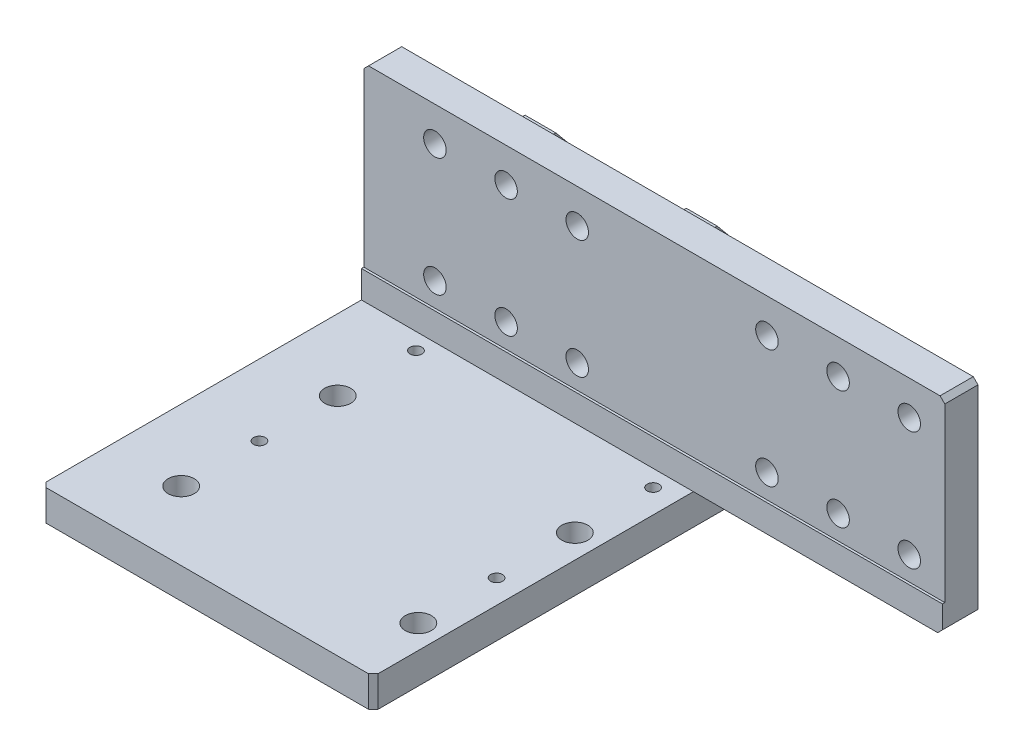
ISO-10303-21;
HEADER;
FILE_DESCRIPTION(('STEP AP214'),'2;1');
FILE_NAME('part.step','',(''),(''),'','','');
FILE_SCHEMA(('AUTOMOTIVE_DESIGN { 1 0 10303 214 1 1 1 1 }'));
ENDSEC;
DATA;
#1=APPLICATION_CONTEXT('core data for automotive mechanical design processes');
#2=APPLICATION_PROTOCOL_DEFINITION('international standard','automotive_design',2000,#1);
#3=PRODUCT_CONTEXT('',#1,'mechanical');
#4=PRODUCT('Part','Part','',(#3));
#5=PRODUCT_RELATED_PRODUCT_CATEGORY('part','',(#4));
#6=PRODUCT_DEFINITION_FORMATION('','',#4);
#7=PRODUCT_DEFINITION_CONTEXT('part definition',#1,'design');
#8=PRODUCT_DEFINITION('design','',#6,#7);
#9=PRODUCT_DEFINITION_SHAPE('','',#8);
#10=(LENGTH_UNIT() NAMED_UNIT(*) SI_UNIT(.MILLI.,.METRE.));
#11=(NAMED_UNIT(*) PLANE_ANGLE_UNIT() SI_UNIT($,.RADIAN.));
#12=(NAMED_UNIT(*) SI_UNIT($,.STERADIAN.) SOLID_ANGLE_UNIT());
#13=UNCERTAINTY_MEASURE_WITH_UNIT(LENGTH_MEASURE(1.E-05),#10,'distance_accuracy_value','');
#14=(GEOMETRIC_REPRESENTATION_CONTEXT(3) GLOBAL_UNCERTAINTY_ASSIGNED_CONTEXT((#13)) GLOBAL_UNIT_ASSIGNED_CONTEXT((#10,
#11,#12)) REPRESENTATION_CONTEXT('',''));
#15=CARTESIAN_POINT('',(0.,0.,0.));
#16=DIRECTION('',(0.,0.,1.));
#17=DIRECTION('',(1.,0.,0.));
#18=AXIS2_PLACEMENT_3D('',#15,#16,#17);
#19=CARTESIAN_POINT('',(37.,85.,-95.));
#20=DIRECTION('',(1.,0.,0.));
#21=DIRECTION('',(0.,0.,-1.));
#22=AXIS2_PLACEMENT_3D('',#19,#20,#21);
#23=PLANE('',#22);
#24=DIRECTION('',(0.,0.,1.));
#25=VECTOR('',#24,1.);
#26=CARTESIAN_POINT('',(37.,85.,-95.));
#27=LINE('',#26,#25);
#28=CARTESIAN_POINT('',(37.,85.,-70.));
#29=VERTEX_POINT('',#28);
#30=CARTESIAN_POINT('',(37.,85.,-55.));
#31=VERTEX_POINT('',#30);
#32=EDGE_CURVE('E105',#29,#31,#27,.T.);
#33=ORIENTED_EDGE('',*,*,#32,.F.);
#34=DIRECTION('',(0.,-0.768221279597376,-0.64018439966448));
#35=VECTOR('',#34,1.);
#36=CARTESIAN_POINT('',(37.,72.7049180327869,-80.2459016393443));
#37=LINE('',#36,#35);
#38=CARTESIAN_POINT('',(37.,55.,-95.));
#39=VERTEX_POINT('',#38);
#40=EDGE_CURVE('E59',#29,#39,#37,.T.);
#41=ORIENTED_EDGE('',*,*,#40,.T.);
#42=DIRECTION('',(0.,-1.,0.));
#43=VECTOR('',#42,1.);
#44=CARTESIAN_POINT('',(37.,85.,-95.));
#45=LINE('',#44,#43);
#46=CARTESIAN_POINT('',(37.,13.,-95.));
#47=VERTEX_POINT('',#46);
#48=EDGE_CURVE('E87',#39,#47,#45,.T.);
#49=ORIENTED_EDGE('',*,*,#48,.T.);
#50=DIRECTION('',(0.,0.,1.));
#51=VECTOR('',#50,1.);
#52=CARTESIAN_POINT('',(37.,13.,-95.));
#53=LINE('',#52,#51);
#54=CARTESIAN_POINT('',(37.,13.,-55.));
#55=VERTEX_POINT('',#54);
#56=EDGE_CURVE('E92',#47,#55,#53,.T.);
#57=ORIENTED_EDGE('',*,*,#56,.T.);
#58=DIRECTION('',(0.,-1.,0.));
#59=VECTOR('',#58,1.);
#60=CARTESIAN_POINT('',(37.,85.,-55.));
#61=LINE('',#60,#59);
#62=EDGE_CURVE('E53',#31,#55,#61,.T.);
#63=ORIENTED_EDGE('',*,*,#62,.F.);
#64=EDGE_LOOP('',(#33,#41,#49,#57,#63));
#65=FACE_BOUND('',#64,.T.);
#66=ADVANCED_FACE('F46',(#65),#23,.F.);
#67=CARTESIAN_POINT('',(37.,85.,-55.));
#68=DIRECTION('',(0.,0.,-1.));
#69=DIRECTION('',(-1.,0.,0.));
#70=AXIS2_PLACEMENT_3D('',#67,#68,#69);
#71=PLANE('',#70);
#72=DIRECTION('',(1.,0.,0.));
#73=VECTOR('',#72,1.);
#74=CARTESIAN_POINT('',(37.,13.,-55.));
#75=LINE('',#74,#73);
#76=CARTESIAN_POINT('',(50.,13.,-55.));
#77=VERTEX_POINT('',#76);
#78=EDGE_CURVE('E109',#55,#77,#75,.T.);
#79=ORIENTED_EDGE('',*,*,#78,.T.);
#80=DIRECTION('',(0.,-1.,0.));
#81=VECTOR('',#80,1.);
#82=CARTESIAN_POINT('',(50.,85.,-55.));
#83=LINE('',#82,#81);
#84=CARTESIAN_POINT('',(50.,85.,-55.));
#85=VERTEX_POINT('',#84);
#86=EDGE_CURVE('E120',#85,#77,#83,.T.);
#87=ORIENTED_EDGE('',*,*,#86,.F.);
#88=DIRECTION('',(1.,0.,0.));
#89=VECTOR('',#88,1.);
#90=CARTESIAN_POINT('',(37.,85.,-55.));
#91=LINE('',#90,#89);
#92=EDGE_CURVE('E68',#31,#85,#91,.T.);
#93=ORIENTED_EDGE('',*,*,#92,.F.);
#94=ORIENTED_EDGE('',*,*,#62,.T.);
#95=EDGE_LOOP('',(#79,#87,#93,#94));
#96=FACE_BOUND('',#95,.T.);
#97=ADVANCED_FACE('F123',(#96),#71,.F.);
#98=CARTESIAN_POINT('',(50.,85.,-95.));
#99=DIRECTION('',(-1.,0.,0.));
#100=DIRECTION('',(0.,0.,1.));
#101=AXIS2_PLACEMENT_3D('',#98,#99,#100);
#102=PLANE('',#101);
#103=DIRECTION('',(0.,-1.,0.));
#104=VECTOR('',#103,1.);
#105=CARTESIAN_POINT('',(50.,85.,-95.));
#106=LINE('',#105,#104);
#107=CARTESIAN_POINT('',(50.,55.,-95.));
#108=VERTEX_POINT('',#107);
#109=CARTESIAN_POINT('',(50.,13.,-95.));
#110=VERTEX_POINT('',#109);
#111=EDGE_CURVE('E95',#108,#110,#106,.T.);
#112=ORIENTED_EDGE('',*,*,#111,.F.);
#113=DIRECTION('',(0.,-0.768221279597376,-0.64018439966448));
#114=VECTOR('',#113,1.);
#115=CARTESIAN_POINT('',(50.,55.,-95.));
#116=LINE('',#115,#114);
#117=CARTESIAN_POINT('',(50.,85.,-70.));
#118=VERTEX_POINT('',#117);
#119=EDGE_CURVE('E127',#118,#108,#116,.T.);
#120=ORIENTED_EDGE('',*,*,#119,.F.);
#121=DIRECTION('',(0.,0.,-1.));
#122=VECTOR('',#121,1.);
#123=CARTESIAN_POINT('',(50.,85.,-95.));
#124=LINE('',#123,#122);
#125=EDGE_CURVE('E96',#85,#118,#124,.T.);
#126=ORIENTED_EDGE('',*,*,#125,.F.);
#127=ORIENTED_EDGE('',*,*,#86,.T.);
#128=DIRECTION('',(0.,0.,-1.));
#129=VECTOR('',#128,1.);
#130=CARTESIAN_POINT('',(50.,13.,-95.));
#131=LINE('',#130,#129);
#132=EDGE_CURVE('E106',#77,#110,#131,.T.);
#133=ORIENTED_EDGE('',*,*,#132,.T.);
#134=EDGE_LOOP('',(#112,#120,#126,#127,#133));
#135=FACE_BOUND('',#134,.T.);
#136=ADVANCED_FACE('F136',(#135),#102,.F.);
#137=CARTESIAN_POINT('',(37.,85.,-95.));
#138=DIRECTION('',(0.,0.,1.));
#139=DIRECTION('',(1.,0.,0.));
#140=AXIS2_PLACEMENT_3D('',#137,#138,#139);
#141=PLANE('',#140);
#142=ORIENTED_EDGE('',*,*,#48,.F.);
#143=DIRECTION('',(1.,0.,0.));
#144=VECTOR('',#143,1.);
#145=CARTESIAN_POINT('',(-70.,55.,-95.));
#146=LINE('',#145,#144);
#147=EDGE_CURVE('E113',#39,#108,#146,.T.);
#148=ORIENTED_EDGE('',*,*,#147,.T.);
#149=ORIENTED_EDGE('',*,*,#111,.T.);
#150=DIRECTION('',(-1.,0.,0.));
#151=VECTOR('',#150,1.);
#152=CARTESIAN_POINT('',(37.,13.,-95.));
#153=LINE('',#152,#151);
#154=EDGE_CURVE('E99',#110,#47,#153,.T.);
#155=ORIENTED_EDGE('',*,*,#154,.T.);
#156=EDGE_LOOP('',(#142,#148,#149,#155));
#157=FACE_BOUND('',#156,.T.);
#158=ADVANCED_FACE('F100',(#157),#141,.F.);
#159=CARTESIAN_POINT('',(0.,85.,0.));
#160=DIRECTION('',(0.,1.,0.));
#161=DIRECTION('',(0.,0.,1.));
#162=AXIS2_PLACEMENT_3D('',#159,#160,#161);
#163=PLANE('',#162);
#164=DIRECTION('',(1.,0.,0.));
#165=VECTOR('',#164,1.);
#166=CARTESIAN_POINT('',(0.,85.,-70.));
#167=LINE('',#166,#165);
#168=EDGE_CURVE('E12',#29,#118,#167,.T.);
#169=ORIENTED_EDGE('',*,*,#168,.F.);
#170=ORIENTED_EDGE('',*,*,#32,.T.);
#171=ORIENTED_EDGE('',*,*,#92,.T.);
#172=ORIENTED_EDGE('',*,*,#125,.T.);
#173=EDGE_LOOP('',(#169,#170,#171,#172));
#174=FACE_BOUND('',#173,.T.);
#175=ADVANCED_FACE('F137',(#174),#163,.T.);
#176=CARTESIAN_POINT('',(0.,13.,0.));
#177=DIRECTION('',(0.,1.,0.));
#178=DIRECTION('',(0.,0.,1.));
#179=AXIS2_PLACEMENT_3D('',#176,#177,#178);
#180=PLANE('',#179);
#181=ORIENTED_EDGE('',*,*,#56,.F.);
#182=ORIENTED_EDGE('',*,*,#154,.F.);
#183=ORIENTED_EDGE('',*,*,#132,.F.);
#184=ORIENTED_EDGE('',*,*,#78,.F.);
#185=EDGE_LOOP('',(#181,#182,#183,#184));
#186=FACE_BOUND('',#185,.T.);
#187=ADVANCED_FACE('F108',(#186),#180,.F.);
#188=CARTESIAN_POINT('',(-70.,55.,-95.));
#189=DIRECTION('',(0.,-0.64018439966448,0.768221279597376));
#190=DIRECTION('',(0.,-0.768221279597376,-0.64018439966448));
#191=AXIS2_PLACEMENT_3D('',#188,#189,#190);
#192=PLANE('',#191);
#193=ORIENTED_EDGE('',*,*,#168,.T.);
#194=ORIENTED_EDGE('',*,*,#119,.T.);
#195=ORIENTED_EDGE('',*,*,#147,.F.);
#196=ORIENTED_EDGE('',*,*,#40,.F.);
#197=EDGE_LOOP('',(#193,#194,#195,#196));
#198=FACE_BOUND('',#197,.T.);
#199=ADVANCED_FACE('F131',(#198),#192,.F.);
#200=CLOSED_SHELL('',(#66,#97,#136,#158,#175,#187,#199));
#201=MANIFOLD_SOLID_BREP('B2',#200);
#202=CARTESIAN_POINT('',(-31.,85.,-95.));
#203=DIRECTION('',(1.,0.,0.));
#204=DIRECTION('',(0.,0.,-1.));
#205=AXIS2_PLACEMENT_3D('',#202,#203,#204);
#206=PLANE('',#205);
#207=DIRECTION('',(0.,0.,1.));
#208=VECTOR('',#207,1.);
#209=CARTESIAN_POINT('',(-31.,85.,-95.));
#210=LINE('',#209,#208);
#211=CARTESIAN_POINT('',(-31.,85.,-70.));
#212=VERTEX_POINT('',#211);
#213=CARTESIAN_POINT('',(-31.,85.,-55.));
#214=VERTEX_POINT('',#213);
#215=EDGE_CURVE('E266',#212,#214,#210,.T.);
#216=ORIENTED_EDGE('',*,*,#215,.F.);
#217=DIRECTION('',(0.,-0.768221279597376,-0.64018439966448));
#218=VECTOR('',#217,1.);
#219=CARTESIAN_POINT('',(-31.,72.7049180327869,-80.2459016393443));
#220=LINE('',#219,#218);
#221=CARTESIAN_POINT('',(-31.,55.,-95.));
#222=VERTEX_POINT('',#221);
#223=EDGE_CURVE('E219',#212,#222,#220,.T.);
#224=ORIENTED_EDGE('',*,*,#223,.T.);
#225=DIRECTION('',(0.,-1.,0.));
#226=VECTOR('',#225,1.);
#227=CARTESIAN_POINT('',(-31.,85.,-95.));
#228=LINE('',#227,#226);
#229=CARTESIAN_POINT('',(-31.,13.,-95.));
#230=VERTEX_POINT('',#229);
#231=EDGE_CURVE('E247',#222,#230,#228,.T.);
#232=ORIENTED_EDGE('',*,*,#231,.T.);
#233=DIRECTION('',(0.,0.,1.));
#234=VECTOR('',#233,1.);
#235=CARTESIAN_POINT('',(-31.,13.,-95.));
#236=LINE('',#235,#234);
#237=CARTESIAN_POINT('',(-31.,13.,-55.));
#238=VERTEX_POINT('',#237);
#239=EDGE_CURVE('E252',#230,#238,#236,.T.);
#240=ORIENTED_EDGE('',*,*,#239,.T.);
#241=DIRECTION('',(0.,-1.,0.));
#242=VECTOR('',#241,1.);
#243=CARTESIAN_POINT('',(-31.,85.,-55.));
#244=LINE('',#243,#242);
#245=EDGE_CURVE('E213',#214,#238,#244,.T.);
#246=ORIENTED_EDGE('',*,*,#245,.F.);
#247=EDGE_LOOP('',(#216,#224,#232,#240,#246));
#248=FACE_BOUND('',#247,.T.);
#249=ADVANCED_FACE('F206',(#248),#206,.F.);
#250=CARTESIAN_POINT('',(-31.,85.,-55.));
#251=DIRECTION('',(0.,0.,-1.));
#252=DIRECTION('',(-1.,0.,0.));
#253=AXIS2_PLACEMENT_3D('',#250,#251,#252);
#254=PLANE('',#253);
#255=DIRECTION('',(1.,0.,0.));
#256=VECTOR('',#255,1.);
#257=CARTESIAN_POINT('',(-31.,13.,-55.));
#258=LINE('',#257,#256);
#259=CARTESIAN_POINT('',(-18.,13.,-55.));
#260=VERTEX_POINT('',#259);
#261=EDGE_CURVE('E270',#238,#260,#258,.T.);
#262=ORIENTED_EDGE('',*,*,#261,.T.);
#263=DIRECTION('',(0.,-1.,0.));
#264=VECTOR('',#263,1.);
#265=CARTESIAN_POINT('',(-18.,85.,-55.));
#266=LINE('',#265,#264);
#267=CARTESIAN_POINT('',(-18.,85.,-55.));
#268=VERTEX_POINT('',#267);
#269=EDGE_CURVE('E281',#268,#260,#266,.T.);
#270=ORIENTED_EDGE('',*,*,#269,.F.);
#271=DIRECTION('',(1.,0.,0.));
#272=VECTOR('',#271,1.);
#273=CARTESIAN_POINT('',(-31.,85.,-55.));
#274=LINE('',#273,#272);
#275=EDGE_CURVE('E228',#214,#268,#274,.T.);
#276=ORIENTED_EDGE('',*,*,#275,.F.);
#277=ORIENTED_EDGE('',*,*,#245,.T.);
#278=EDGE_LOOP('',(#262,#270,#276,#277));
#279=FACE_BOUND('',#278,.T.);
#280=ADVANCED_FACE('F284',(#279),#254,.F.);
#281=CARTESIAN_POINT('',(-18.,85.,-95.));
#282=DIRECTION('',(-1.,0.,0.));
#283=DIRECTION('',(0.,0.,1.));
#284=AXIS2_PLACEMENT_3D('',#281,#282,#283);
#285=PLANE('',#284);
#286=DIRECTION('',(0.,-1.,0.));
#287=VECTOR('',#286,1.);
#288=CARTESIAN_POINT('',(-18.,85.,-95.));
#289=LINE('',#288,#287);
#290=CARTESIAN_POINT('',(-18.,55.,-95.));
#291=VERTEX_POINT('',#290);
#292=CARTESIAN_POINT('',(-18.,13.,-95.));
#293=VERTEX_POINT('',#292);
#294=EDGE_CURVE('E256',#291,#293,#289,.T.);
#295=ORIENTED_EDGE('',*,*,#294,.F.);
#296=DIRECTION('',(0.,0.768221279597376,0.64018439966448));
#297=VECTOR('',#296,1.);
#298=CARTESIAN_POINT('',(-18.,72.7049180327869,-80.2459016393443));
#299=LINE('',#298,#297);
#300=CARTESIAN_POINT('',(-18.,85.,-70.));
#301=VERTEX_POINT('',#300);
#302=EDGE_CURVE('E274',#291,#301,#299,.T.);
#303=ORIENTED_EDGE('',*,*,#302,.T.);
#304=DIRECTION('',(0.,0.,-1.));
#305=VECTOR('',#304,1.);
#306=CARTESIAN_POINT('',(-18.,85.,-95.));
#307=LINE('',#306,#305);
#308=EDGE_CURVE('E257',#268,#301,#307,.T.);
#309=ORIENTED_EDGE('',*,*,#308,.F.);
#310=ORIENTED_EDGE('',*,*,#269,.T.);
#311=DIRECTION('',(0.,0.,-1.));
#312=VECTOR('',#311,1.);
#313=CARTESIAN_POINT('',(-18.,13.,-95.));
#314=LINE('',#313,#312);
#315=EDGE_CURVE('E267',#260,#293,#314,.T.);
#316=ORIENTED_EDGE('',*,*,#315,.T.);
#317=EDGE_LOOP('',(#295,#303,#309,#310,#316));
#318=FACE_BOUND('',#317,.T.);
#319=ADVANCED_FACE('F292',(#318),#285,.F.);
#320=CARTESIAN_POINT('',(-31.,85.,-95.));
#321=DIRECTION('',(0.,0.,1.));
#322=DIRECTION('',(1.,0.,0.));
#323=AXIS2_PLACEMENT_3D('',#320,#321,#322);
#324=PLANE('',#323);
#325=ORIENTED_EDGE('',*,*,#231,.F.);
#326=DIRECTION('',(1.,0.,0.));
#327=VECTOR('',#326,1.);
#328=CARTESIAN_POINT('',(-70.,55.,-95.));
#329=LINE('',#328,#327);
#330=EDGE_CURVE('E289',#222,#291,#329,.T.);
#331=ORIENTED_EDGE('',*,*,#330,.T.);
#332=ORIENTED_EDGE('',*,*,#294,.T.);
#333=DIRECTION('',(-1.,0.,0.));
#334=VECTOR('',#333,1.);
#335=CARTESIAN_POINT('',(-31.,13.,-95.));
#336=LINE('',#335,#334);
#337=EDGE_CURVE('E260',#293,#230,#336,.T.);
#338=ORIENTED_EDGE('',*,*,#337,.T.);
#339=EDGE_LOOP('',(#325,#331,#332,#338));
#340=FACE_BOUND('',#339,.T.);
#341=ADVANCED_FACE('F261',(#340),#324,.F.);
#342=CARTESIAN_POINT('',(0.,85.,0.));
#343=DIRECTION('',(0.,1.,0.));
#344=DIRECTION('',(0.,0.,1.));
#345=AXIS2_PLACEMENT_3D('',#342,#343,#344);
#346=PLANE('',#345);
#347=DIRECTION('',(1.,0.,0.));
#348=VECTOR('',#347,1.);
#349=CARTESIAN_POINT('',(0.,85.,-70.));
#350=LINE('',#349,#348);
#351=EDGE_CURVE('E44',#212,#301,#350,.T.);
#352=ORIENTED_EDGE('',*,*,#351,.F.);
#353=ORIENTED_EDGE('',*,*,#215,.T.);
#354=ORIENTED_EDGE('',*,*,#275,.T.);
#355=ORIENTED_EDGE('',*,*,#308,.T.);
#356=EDGE_LOOP('',(#352,#353,#354,#355));
#357=FACE_BOUND('',#356,.T.);
#358=ADVANCED_FACE('F295',(#357),#346,.T.);
#359=CARTESIAN_POINT('',(0.,13.,0.));
#360=DIRECTION('',(0.,1.,0.));
#361=DIRECTION('',(0.,0.,1.));
#362=AXIS2_PLACEMENT_3D('',#359,#360,#361);
#363=PLANE('',#362);
#364=ORIENTED_EDGE('',*,*,#239,.F.);
#365=ORIENTED_EDGE('',*,*,#337,.F.);
#366=ORIENTED_EDGE('',*,*,#315,.F.);
#367=ORIENTED_EDGE('',*,*,#261,.F.);
#368=EDGE_LOOP('',(#364,#365,#366,#367));
#369=FACE_BOUND('',#368,.T.);
#370=ADVANCED_FACE('F269',(#369),#363,.F.);
#371=CARTESIAN_POINT('',(-70.,55.,-95.));
#372=DIRECTION('',(0.,-0.64018439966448,0.768221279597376));
#373=DIRECTION('',(0.,-0.768221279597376,-0.64018439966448));
#374=AXIS2_PLACEMENT_3D('',#371,#372,#373);
#375=PLANE('',#374);
#376=ORIENTED_EDGE('',*,*,#351,.T.);
#377=ORIENTED_EDGE('',*,*,#302,.F.);
#378=ORIENTED_EDGE('',*,*,#330,.F.);
#379=ORIENTED_EDGE('',*,*,#223,.F.);
#380=EDGE_LOOP('',(#376,#377,#378,#379));
#381=FACE_BOUND('',#380,.T.);
#382=ADVANCED_FACE('F298',(#381),#375,.F.);
#383=CLOSED_SHELL('',(#249,#280,#319,#341,#358,#370,#382));
#384=MANIFOLD_SOLID_BREP('B6',#383);
#385=CARTESIAN_POINT('',(0.,99.,0.));
#386=DIRECTION('',(0.,1.,0.));
#387=DIRECTION('',(0.,0.,1.));
#388=AXIS2_PLACEMENT_3D('',#385,#386,#387);
#389=PLANE('',#388);
#390=DIRECTION('',(-1.,0.,0.));
#391=VECTOR('',#390,1.);
#392=CARTESIAN_POINT('',(-70.,99.,-41.));
#393=LINE('',#392,#391);
#394=CARTESIAN_POINT('',(173.,99.,-41.));
#395=VERTEX_POINT('',#394);
#396=CARTESIAN_POINT('',(-68.,99.,-41.));
#397=VERTEX_POINT('',#396);
#398=EDGE_CURVE('E455',#395,#397,#393,.T.);
#399=ORIENTED_EDGE('',*,*,#398,.F.);
#400=DIRECTION('',(0.,0.,-1.));
#401=VECTOR('',#400,1.);
#402=CARTESIAN_POINT('',(173.,99.,-55.));
#403=LINE('',#402,#401);
#404=CARTESIAN_POINT('',(173.,99.,-55.));
#405=VERTEX_POINT('',#404);
#406=EDGE_CURVE('E527',#395,#405,#403,.T.);
#407=ORIENTED_EDGE('',*,*,#406,.T.);
#408=DIRECTION('',(-1.,0.,0.));
#409=VECTOR('',#408,1.);
#410=CARTESIAN_POINT('',(-70.,99.,-55.));
#411=LINE('',#410,#409);
#412=CARTESIAN_POINT('',(-68.,99.,-55.));
#413=VERTEX_POINT('',#412);
#414=EDGE_CURVE('E462',#405,#413,#411,.T.);
#415=ORIENTED_EDGE('',*,*,#414,.T.);
#416=DIRECTION('',(0.,0.,1.));
#417=VECTOR('',#416,1.);
#418=CARTESIAN_POINT('',(-68.,99.,-41.));
#419=LINE('',#418,#417);
#420=EDGE_CURVE('E525',#413,#397,#419,.T.);
#421=ORIENTED_EDGE('',*,*,#420,.T.);
#422=EDGE_LOOP('',(#399,#407,#415,#421));
#423=FACE_BOUND('',#422,.T.);
#424=ADVANCED_FACE('F365',(#423),#389,.T.);
#425=CARTESIAN_POINT('',(-70.,99.,-55.));
#426=DIRECTION('',(1.,0.,0.));
#427=DIRECTION('',(0.,0.,-1.));
#428=AXIS2_PLACEMENT_3D('',#425,#426,#427);
#429=PLANE('',#428);
#430=DIRECTION('',(0.,-1.,0.));
#431=VECTOR('',#430,1.);
#432=CARTESIAN_POINT('',(-70.,99.,-41.));
#433=LINE('',#432,#431);
#434=CARTESIAN_POINT('',(-70.,97.,-41.));
#435=VERTEX_POINT('',#434);
#436=CARTESIAN_POINT('',(-70.,24.5,-41.));
#437=VERTEX_POINT('',#436);
#438=EDGE_CURVE('E433',#435,#437,#433,.T.);
#439=ORIENTED_EDGE('',*,*,#438,.F.);
#440=DIRECTION('',(0.,0.,-1.));
#441=VECTOR('',#440,1.);
#442=CARTESIAN_POINT('',(-70.,97.,-55.));
#443=LINE('',#442,#441);
#444=CARTESIAN_POINT('',(-70.,97.,-55.));
#445=VERTEX_POINT('',#444);
#446=EDGE_CURVE('E204',#435,#445,#443,.T.);
#447=ORIENTED_EDGE('',*,*,#446,.T.);
#448=DIRECTION('',(0.,-1.,0.));
#449=VECTOR('',#448,1.);
#450=CARTESIAN_POINT('',(-70.,99.,-55.));
#451=LINE('',#450,#449);
#452=CARTESIAN_POINT('',(-70.,13.,-55.));
#453=VERTEX_POINT('',#452);
#454=EDGE_CURVE('E465',#445,#453,#451,.T.);
#455=ORIENTED_EDGE('',*,*,#454,.T.);
#456=DIRECTION('',(0.,0.,1.));
#457=VECTOR('',#456,1.);
#458=CARTESIAN_POINT('',(-70.,13.,-55.));
#459=LINE('',#458,#457);
#460=CARTESIAN_POINT('',(-70.,13.,-40.));
#461=VERTEX_POINT('',#460);
#462=EDGE_CURVE('E457',#453,#461,#459,.T.);
#463=ORIENTED_EDGE('',*,*,#462,.T.);
#464=DIRECTION('',(0.,-1.,0.));
#465=VECTOR('',#464,1.);
#466=CARTESIAN_POINT('',(-70.,99.,-40.));
#467=LINE('',#466,#465);
#468=CARTESIAN_POINT('',(-70.,24.5,-40.));
#469=VERTEX_POINT('',#468);
#470=EDGE_CURVE('E454',#469,#461,#467,.T.);
#471=ORIENTED_EDGE('',*,*,#470,.F.);
#472=DIRECTION('',(0.,0.,1.));
#473=VECTOR('',#472,1.);
#474=CARTESIAN_POINT('',(-70.,24.5,-41.));
#475=LINE('',#474,#473);
#476=EDGE_CURVE('E445',#437,#469,#475,.T.);
#477=ORIENTED_EDGE('',*,*,#476,.F.);
#478=EDGE_LOOP('',(#439,#447,#455,#463,#471,#477));
#479=FACE_BOUND('',#478,.T.);
#480=ADVANCED_FACE('F452',(#479),#429,.F.);
#481=CARTESIAN_POINT('',(-70.,99.,-40.));
#482=DIRECTION('',(0.,0.,-1.));
#483=DIRECTION('',(-1.,0.,0.));
#484=AXIS2_PLACEMENT_3D('',#481,#482,#483);
#485=PLANE('',#484);
#486=DIRECTION('',(1.,0.,0.));
#487=VECTOR('',#486,1.);
#488=CARTESIAN_POINT('',(-70.,13.,-40.));
#489=LINE('',#488,#487);
#490=CARTESIAN_POINT('',(173.,13.,-40.));
#491=VERTEX_POINT('',#490);
#492=EDGE_CURVE('E468',#461,#491,#489,.T.);
#493=ORIENTED_EDGE('',*,*,#492,.T.);
#494=DIRECTION('',(-0.707106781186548,-0.707106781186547,0.));
#495=VECTOR('',#494,1.);
#496=CARTESIAN_POINT('',(175.,15.,-40.));
#497=LINE('',#496,#495);
#498=CARTESIAN_POINT('',(175.,15.,-40.));
#499=VERTEX_POINT('',#498);
#500=EDGE_CURVE('E523',#491,#499,#497,.F.);
#501=ORIENTED_EDGE('',*,*,#500,.T.);
#502=DIRECTION('',(0.,-1.,0.));
#503=VECTOR('',#502,1.);
#504=CARTESIAN_POINT('',(175.,99.,-40.));
#505=LINE('',#504,#503);
#506=CARTESIAN_POINT('',(175.,24.5,-40.));
#507=VERTEX_POINT('',#506);
#508=EDGE_CURVE('E477',#507,#499,#505,.T.);
#509=ORIENTED_EDGE('',*,*,#508,.F.);
#510=DIRECTION('',(1.,0.,0.));
#511=VECTOR('',#510,1.);
#512=CARTESIAN_POINT('',(-70.,24.5,-40.));
#513=LINE('',#512,#511);
#514=EDGE_CURVE('E441',#469,#507,#513,.T.);
#515=ORIENTED_EDGE('',*,*,#514,.F.);
#516=ORIENTED_EDGE('',*,*,#470,.T.);
#517=EDGE_LOOP('',(#493,#501,#509,#515,#516));
#518=FACE_BOUND('',#517,.T.);
#519=ADVANCED_FACE('F565',(#518),#485,.F.);
#520=CARTESIAN_POINT('',(175.,99.,-55.));
#521=DIRECTION('',(-1.,0.,0.));
#522=DIRECTION('',(0.,0.,1.));
#523=AXIS2_PLACEMENT_3D('',#520,#521,#522);
#524=PLANE('',#523);
#525=ORIENTED_EDGE('',*,*,#508,.T.);
#526=DIRECTION('',(0.,0.,-1.));
#527=VECTOR('',#526,1.);
#528=CARTESIAN_POINT('',(175.,15.,-55.));
#529=LINE('',#528,#527);
#530=CARTESIAN_POINT('',(175.,15.,-55.));
#531=VERTEX_POINT('',#530);
#532=EDGE_CURVE('E512',#499,#531,#529,.T.);
#533=ORIENTED_EDGE('',*,*,#532,.T.);
#534=DIRECTION('',(0.,-1.,0.));
#535=VECTOR('',#534,1.);
#536=CARTESIAN_POINT('',(175.,99.,-55.));
#537=LINE('',#536,#535);
#538=CARTESIAN_POINT('',(175.,97.,-55.));
#539=VERTEX_POINT('',#538);
#540=EDGE_CURVE('E474',#539,#531,#537,.T.);
#541=ORIENTED_EDGE('',*,*,#540,.F.);
#542=DIRECTION('',(0.,0.,1.));
#543=VECTOR('',#542,1.);
#544=CARTESIAN_POINT('',(175.,97.,-41.));
#545=LINE('',#544,#543);
#546=CARTESIAN_POINT('',(175.,97.,-41.));
#547=VERTEX_POINT('',#546);
#548=EDGE_CURVE('E481',#539,#547,#545,.T.);
#549=ORIENTED_EDGE('',*,*,#548,.T.);
#550=DIRECTION('',(0.,1.,0.));
#551=VECTOR('',#550,1.);
#552=CARTESIAN_POINT('',(175.,99.,-41.));
#553=LINE('',#552,#551);
#554=CARTESIAN_POINT('',(175.,24.5,-41.));
#555=VERTEX_POINT('',#554);
#556=EDGE_CURVE('E449',#555,#547,#553,.T.);
#557=ORIENTED_EDGE('',*,*,#556,.F.);
#558=DIRECTION('',(0.,0.,1.));
#559=VECTOR('',#558,1.);
#560=CARTESIAN_POINT('',(175.,24.5,-41.));
#561=LINE('',#560,#559);
#562=EDGE_CURVE('E448',#555,#507,#561,.T.);
#563=ORIENTED_EDGE('',*,*,#562,.T.);
#564=EDGE_LOOP('',(#525,#533,#541,#549,#557,#563));
#565=FACE_BOUND('',#564,.T.);
#566=ADVANCED_FACE('F542',(#565),#524,.F.);
#567=CARTESIAN_POINT('',(-70.,99.,-55.));
#568=DIRECTION('',(0.,0.,1.));
#569=DIRECTION('',(1.,0.,0.));
#570=AXIS2_PLACEMENT_3D('',#567,#568,#569);
#571=PLANE('',#570);
#572=CARTESIAN_POINT('',(130.,84.5,-55.));
#573=DIRECTION('',(0.,0.,1.));
#574=DIRECTION('',(1.,0.,0.));
#575=AXIS2_PLACEMENT_3D('',#572,#573,#574);
#576=CIRCLE('',#575,2.75);
#577=CARTESIAN_POINT('',(132.75,84.5,-55.));
#578=VERTEX_POINT('',#577);
#579=EDGE_CURVE('E879',#578,#578,#576,.T.);
#580=ORIENTED_EDGE('',*,*,#579,.T.);
#581=EDGE_LOOP('',(#580));
#582=FACE_BOUND('',#581,.T.);
#583=CARTESIAN_POINT('',(100.,34.5,-55.));
#584=DIRECTION('',(0.,0.,1.));
#585=DIRECTION('',(1.,0.,0.));
#586=AXIS2_PLACEMENT_3D('',#583,#584,#585);
#587=CIRCLE('',#586,2.75);
#588=CARTESIAN_POINT('',(102.75,34.5,-55.));
#589=VERTEX_POINT('',#588);
#590=EDGE_CURVE('E869',#589,#589,#587,.T.);
#591=ORIENTED_EDGE('',*,*,#590,.T.);
#592=EDGE_LOOP('',(#591));
#593=FACE_BOUND('',#592,.T.);
#594=CARTESIAN_POINT('',(130.,34.5,-55.));
#595=DIRECTION('',(0.,0.,1.));
#596=DIRECTION('',(1.,0.,0.));
#597=AXIS2_PLACEMENT_3D('',#594,#595,#596);
#598=CIRCLE('',#597,2.75);
#599=CARTESIAN_POINT('',(132.75,34.5,-55.));
#600=VERTEX_POINT('',#599);
#601=EDGE_CURVE('E859',#600,#600,#598,.T.);
#602=ORIENTED_EDGE('',*,*,#601,.T.);
#603=EDGE_LOOP('',(#602));
#604=FACE_BOUND('',#603,.T.);
#605=CARTESIAN_POINT('',(160.,34.5,-55.));
#606=DIRECTION('',(0.,0.,1.));
#607=DIRECTION('',(1.,0.,0.));
#608=AXIS2_PLACEMENT_3D('',#605,#606,#607);
#609=CIRCLE('',#608,2.75);
#610=CARTESIAN_POINT('',(162.75,34.5,-55.));
#611=VERTEX_POINT('',#610);
#612=EDGE_CURVE('E849',#611,#611,#609,.T.);
#613=ORIENTED_EDGE('',*,*,#612,.T.);
#614=EDGE_LOOP('',(#613));
#615=FACE_BOUND('',#614,.T.);
#616=CARTESIAN_POINT('',(160.,84.5,-55.));
#617=DIRECTION('',(0.,0.,1.));
#618=DIRECTION('',(1.,0.,0.));
#619=AXIS2_PLACEMENT_3D('',#616,#617,#618);
#620=CIRCLE('',#619,2.75);
#621=CARTESIAN_POINT('',(162.75,84.5,-55.));
#622=VERTEX_POINT('',#621);
#623=EDGE_CURVE('E839',#622,#622,#620,.T.);
#624=ORIENTED_EDGE('',*,*,#623,.T.);
#625=EDGE_LOOP('',(#624));
#626=FACE_BOUND('',#625,.T.);
#627=CARTESIAN_POINT('',(100.,84.5,-55.));
#628=DIRECTION('',(0.,0.,1.));
#629=DIRECTION('',(1.,0.,0.));
#630=AXIS2_PLACEMENT_3D('',#627,#628,#629);
#631=CIRCLE('',#630,2.75);
#632=CARTESIAN_POINT('',(102.75,84.5,-55.));
#633=VERTEX_POINT('',#632);
#634=EDGE_CURVE('E829',#633,#633,#631,.T.);
#635=ORIENTED_EDGE('',*,*,#634,.T.);
#636=EDGE_LOOP('',(#635));
#637=FACE_BOUND('',#636,.T.);
#638=CARTESIAN_POINT('',(-40.,84.5,-55.));
#639=DIRECTION('',(0.,0.,1.));
#640=DIRECTION('',(1.,0.,0.));
#641=AXIS2_PLACEMENT_3D('',#638,#639,#640);
#642=CIRCLE('',#641,2.75);
#643=CARTESIAN_POINT('',(-37.25,84.5,-55.));
#644=VERTEX_POINT('',#643);
#645=EDGE_CURVE('E506',#644,#644,#642,.T.);
#646=ORIENTED_EDGE('',*,*,#645,.T.);
#647=EDGE_LOOP('',(#646));
#648=FACE_BOUND('',#647,.T.);
#649=CARTESIAN_POINT('',(-10.,84.5,-55.));
#650=DIRECTION('',(0.,0.,1.));
#651=DIRECTION('',(1.,0.,0.));
#652=AXIS2_PLACEMENT_3D('',#649,#650,#651);
#653=CIRCLE('',#652,2.75);
#654=CARTESIAN_POINT('',(-7.25000000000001,84.5,-55.));
#655=VERTEX_POINT('',#654);
#656=EDGE_CURVE('E501',#655,#655,#653,.T.);
#657=ORIENTED_EDGE('',*,*,#656,.T.);
#658=EDGE_LOOP('',(#657));
#659=FACE_BOUND('',#658,.T.);
#660=CARTESIAN_POINT('',(-40.,34.5,-55.));
#661=DIRECTION('',(0.,0.,1.));
#662=DIRECTION('',(1.,0.,0.));
#663=AXIS2_PLACEMENT_3D('',#660,#661,#662);
#664=CIRCLE('',#663,2.75);
#665=CARTESIAN_POINT('',(-37.25,34.5,-55.));
#666=VERTEX_POINT('',#665);
#667=EDGE_CURVE('E496',#666,#666,#664,.T.);
#668=ORIENTED_EDGE('',*,*,#667,.T.);
#669=EDGE_LOOP('',(#668));
#670=FACE_BOUND('',#669,.T.);
#671=CARTESIAN_POINT('',(-10.,34.5,-55.));
#672=DIRECTION('',(0.,0.,1.));
#673=DIRECTION('',(1.,0.,0.));
#674=AXIS2_PLACEMENT_3D('',#671,#672,#673);
#675=CIRCLE('',#674,2.75);
#676=CARTESIAN_POINT('',(-7.25000000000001,34.5,-55.));
#677=VERTEX_POINT('',#676);
#678=EDGE_CURVE('E491',#677,#677,#675,.T.);
#679=ORIENTED_EDGE('',*,*,#678,.T.);
#680=EDGE_LOOP('',(#679));
#681=FACE_BOUND('',#680,.T.);
#682=CARTESIAN_POINT('',(20.,34.5,-55.));
#683=DIRECTION('',(0.,0.,1.));
#684=DIRECTION('',(1.,0.,0.));
#685=AXIS2_PLACEMENT_3D('',#682,#683,#684);
#686=CIRCLE('',#685,2.75);
#687=CARTESIAN_POINT('',(22.75,34.5,-55.));
#688=VERTEX_POINT('',#687);
#689=EDGE_CURVE('E486',#688,#688,#686,.T.);
#690=ORIENTED_EDGE('',*,*,#689,.T.);
#691=EDGE_LOOP('',(#690));
#692=FACE_BOUND('',#691,.T.);
#693=CARTESIAN_POINT('',(20.,84.5,-55.));
#694=DIRECTION('',(0.,0.,1.));
#695=DIRECTION('',(1.,0.,0.));
#696=AXIS2_PLACEMENT_3D('',#693,#694,#695);
#697=CIRCLE('',#696,2.75);
#698=CARTESIAN_POINT('',(22.75,84.5,-55.));
#699=VERTEX_POINT('',#698);
#700=EDGE_CURVE('E482',#699,#699,#697,.T.);
#701=ORIENTED_EDGE('',*,*,#700,.T.);
#702=EDGE_LOOP('',(#701));
#703=FACE_BOUND('',#702,.T.);
#704=ORIENTED_EDGE('',*,*,#540,.T.);
#705=DIRECTION('',(0.707106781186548,0.707106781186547,0.));
#706=VECTOR('',#705,1.);
#707=CARTESIAN_POINT('',(175.,15.,-55.));
#708=LINE('',#707,#706);
#709=CARTESIAN_POINT('',(173.,13.,-55.));
#710=VERTEX_POINT('',#709);
#711=EDGE_CURVE('E519',#531,#710,#708,.F.);
#712=ORIENTED_EDGE('',*,*,#711,.T.);
#713=DIRECTION('',(-1.,0.,0.));
#714=VECTOR('',#713,1.);
#715=CARTESIAN_POINT('',(-70.,13.,-55.));
#716=LINE('',#715,#714);
#717=EDGE_CURVE('E466',#710,#453,#716,.T.);
#718=ORIENTED_EDGE('',*,*,#717,.T.);
#719=ORIENTED_EDGE('',*,*,#454,.F.);
#720=DIRECTION('',(0.707106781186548,0.707106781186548,0.));
#721=VECTOR('',#720,1.);
#722=CARTESIAN_POINT('',(-68.,99.,-55.));
#723=LINE('',#722,#721);
#724=EDGE_CURVE('E515',#445,#413,#723,.T.);
#725=ORIENTED_EDGE('',*,*,#724,.T.);
#726=ORIENTED_EDGE('',*,*,#414,.F.);
#727=DIRECTION('',(0.707106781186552,-0.707106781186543,0.));
#728=VECTOR('',#727,1.);
#729=CARTESIAN_POINT('',(173.,99.,-55.));
#730=LINE('',#729,#728);
#731=EDGE_CURVE('E517',#405,#539,#730,.T.);
#732=ORIENTED_EDGE('',*,*,#731,.T.);
#733=EDGE_LOOP('',(#704,#712,#718,#719,#725,#726,#732));
#734=FACE_BOUND('',#733,.T.);
#735=ADVANCED_FACE('F540',(#582,#593,#604,#615,#626,#637,#648,#659,#670,#681,#692,#703,#734),
#571,.F.);
#736=CARTESIAN_POINT('',(0.,13.,0.));
#737=DIRECTION('',(0.,1.,0.));
#738=DIRECTION('',(0.,0.,1.));
#739=AXIS2_PLACEMENT_3D('',#736,#737,#738);
#740=PLANE('',#739);
#741=ORIENTED_EDGE('',*,*,#717,.F.);
#742=DIRECTION('',(0.,0.,1.));
#743=VECTOR('',#742,1.);
#744=CARTESIAN_POINT('',(173.,13.,0.));
#745=LINE('',#744,#743);
#746=EDGE_CURVE('E521',#710,#491,#745,.T.);
#747=ORIENTED_EDGE('',*,*,#746,.T.);
#748=ORIENTED_EDGE('',*,*,#492,.F.);
#749=ORIENTED_EDGE('',*,*,#462,.F.);
#750=EDGE_LOOP('',(#741,#747,#748,#749));
#751=FACE_BOUND('',#750,.T.);
#752=ADVANCED_FACE('F553',(#751),#740,.F.);
#753=CARTESIAN_POINT('',(-70.,24.5,-41.));
#754=DIRECTION('',(0.,-1.,0.));
#755=DIRECTION('',(1.,0.,0.));
#756=AXIS2_PLACEMENT_3D('',#753,#754,#755);
#757=PLANE('',#756);
#758=ORIENTED_EDGE('',*,*,#514,.T.);
#759=ORIENTED_EDGE('',*,*,#562,.F.);
#760=DIRECTION('',(1.,0.,0.));
#761=VECTOR('',#760,1.);
#762=CARTESIAN_POINT('',(-70.,24.5,-41.));
#763=LINE('',#762,#761);
#764=EDGE_CURVE('E437',#437,#555,#763,.T.);
#765=ORIENTED_EDGE('',*,*,#764,.F.);
#766=ORIENTED_EDGE('',*,*,#476,.T.);
#767=EDGE_LOOP('',(#758,#759,#765,#766));
#768=FACE_BOUND('',#767,.T.);
#769=ADVANCED_FACE('F444',(#768),#757,.F.);
#770=CARTESIAN_POINT('',(0.,0.,-41.));
#771=DIRECTION('',(0.,0.,1.));
#772=DIRECTION('',(1.,0.,0.));
#773=AXIS2_PLACEMENT_3D('',#770,#771,#772);
#774=PLANE('',#773);
#775=CARTESIAN_POINT('',(130.,84.5,-41.));
#776=DIRECTION('',(0.,0.,1.));
#777=DIRECTION('',(1.,0.,0.));
#778=AXIS2_PLACEMENT_3D('',#775,#776,#777);
#779=CIRCLE('',#778,4.75);
#780=CARTESIAN_POINT('',(134.75,84.5,-41.));
#781=VERTEX_POINT('',#780);
#782=EDGE_CURVE('E739',#781,#781,#779,.T.);
#783=ORIENTED_EDGE('',*,*,#782,.F.);
#784=EDGE_LOOP('',(#783));
#785=FACE_BOUND('',#784,.T.);
#786=CARTESIAN_POINT('',(100.,34.5,-41.));
#787=DIRECTION('',(0.,0.,1.));
#788=DIRECTION('',(1.,0.,0.));
#789=AXIS2_PLACEMENT_3D('',#786,#787,#788);
#790=CIRCLE('',#789,4.75);
#791=CARTESIAN_POINT('',(104.75,34.5,-41.));
#792=VERTEX_POINT('',#791);
#793=EDGE_CURVE('E743',#792,#792,#790,.T.);
#794=ORIENTED_EDGE('',*,*,#793,.F.);
#795=EDGE_LOOP('',(#794));
#796=FACE_BOUND('',#795,.T.);
#797=CARTESIAN_POINT('',(130.,34.5,-41.));
#798=DIRECTION('',(0.,0.,1.));
#799=DIRECTION('',(1.,0.,0.));
#800=AXIS2_PLACEMENT_3D('',#797,#798,#799);
#801=CIRCLE('',#800,4.75);
#802=CARTESIAN_POINT('',(134.75,34.5,-41.));
#803=VERTEX_POINT('',#802);
#804=EDGE_CURVE('E747',#803,#803,#801,.T.);
#805=ORIENTED_EDGE('',*,*,#804,.F.);
#806=EDGE_LOOP('',(#805));
#807=FACE_BOUND('',#806,.T.);
#808=CARTESIAN_POINT('',(160.,34.5,-41.));
#809=DIRECTION('',(0.,0.,1.));
#810=DIRECTION('',(1.,0.,0.));
#811=AXIS2_PLACEMENT_3D('',#808,#809,#810);
#812=CIRCLE('',#811,4.75);
#813=CARTESIAN_POINT('',(164.75,34.5,-41.));
#814=VERTEX_POINT('',#813);
#815=EDGE_CURVE('E751',#814,#814,#812,.T.);
#816=ORIENTED_EDGE('',*,*,#815,.F.);
#817=EDGE_LOOP('',(#816));
#818=FACE_BOUND('',#817,.T.);
#819=CARTESIAN_POINT('',(160.,84.5,-41.));
#820=DIRECTION('',(0.,0.,1.));
#821=DIRECTION('',(1.,0.,0.));
#822=AXIS2_PLACEMENT_3D('',#819,#820,#821);
#823=CIRCLE('',#822,4.75);
#824=CARTESIAN_POINT('',(164.75,84.5,-41.));
#825=VERTEX_POINT('',#824);
#826=EDGE_CURVE('E755',#825,#825,#823,.T.);
#827=ORIENTED_EDGE('',*,*,#826,.F.);
#828=EDGE_LOOP('',(#827));
#829=FACE_BOUND('',#828,.T.);
#830=CARTESIAN_POINT('',(100.,84.5,-41.));
#831=DIRECTION('',(0.,0.,1.));
#832=DIRECTION('',(1.,0.,0.));
#833=AXIS2_PLACEMENT_3D('',#830,#831,#832);
#834=CIRCLE('',#833,4.75);
#835=CARTESIAN_POINT('',(104.75,84.5,-41.));
#836=VERTEX_POINT('',#835);
#837=EDGE_CURVE('E759',#836,#836,#834,.T.);
#838=ORIENTED_EDGE('',*,*,#837,.F.);
#839=EDGE_LOOP('',(#838));
#840=FACE_BOUND('',#839,.T.);
#841=CARTESIAN_POINT('',(-40.,84.5,-41.));
#842=DIRECTION('',(0.,0.,1.));
#843=DIRECTION('',(1.,0.,0.));
#844=AXIS2_PLACEMENT_3D('',#841,#842,#843);
#845=CIRCLE('',#844,4.75);
#846=CARTESIAN_POINT('',(-35.25,84.5,-41.));
#847=VERTEX_POINT('',#846);
#848=EDGE_CURVE('E763',#847,#847,#845,.T.);
#849=ORIENTED_EDGE('',*,*,#848,.F.);
#850=EDGE_LOOP('',(#849));
#851=FACE_BOUND('',#850,.T.);
#852=CARTESIAN_POINT('',(-10.,84.5,-41.));
#853=DIRECTION('',(0.,0.,1.));
#854=DIRECTION('',(1.,0.,0.));
#855=AXIS2_PLACEMENT_3D('',#852,#853,#854);
#856=CIRCLE('',#855,4.75);
#857=CARTESIAN_POINT('',(-5.25000000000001,84.5,-41.));
#858=VERTEX_POINT('',#857);
#859=EDGE_CURVE('E509',#858,#858,#856,.T.);
#860=ORIENTED_EDGE('',*,*,#859,.F.);
#861=EDGE_LOOP('',(#860));
#862=FACE_BOUND('',#861,.T.);
#863=CARTESIAN_POINT('',(-40.,34.5,-41.));
#864=DIRECTION('',(0.,0.,1.));
#865=DIRECTION('',(1.,0.,0.));
#866=AXIS2_PLACEMENT_3D('',#863,#864,#865);
#867=CIRCLE('',#866,4.75);
#868=CARTESIAN_POINT('',(-35.25,34.5,-41.));
#869=VERTEX_POINT('',#868);
#870=EDGE_CURVE('E504',#869,#869,#867,.T.);
#871=ORIENTED_EDGE('',*,*,#870,.F.);
#872=EDGE_LOOP('',(#871));
#873=FACE_BOUND('',#872,.T.);
#874=CARTESIAN_POINT('',(-10.,34.5,-41.));
#875=DIRECTION('',(0.,0.,1.));
#876=DIRECTION('',(1.,0.,0.));
#877=AXIS2_PLACEMENT_3D('',#874,#875,#876);
#878=CIRCLE('',#877,4.75);
#879=CARTESIAN_POINT('',(-5.25000000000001,34.5,-41.));
#880=VERTEX_POINT('',#879);
#881=EDGE_CURVE('E499',#880,#880,#878,.T.);
#882=ORIENTED_EDGE('',*,*,#881,.F.);
#883=EDGE_LOOP('',(#882));
#884=FACE_BOUND('',#883,.T.);
#885=CARTESIAN_POINT('',(20.,34.5,-41.));
#886=DIRECTION('',(0.,0.,1.));
#887=DIRECTION('',(1.,0.,0.));
#888=AXIS2_PLACEMENT_3D('',#885,#886,#887);
#889=CIRCLE('',#888,4.75);
#890=CARTESIAN_POINT('',(24.75,34.5,-41.));
#891=VERTEX_POINT('',#890);
#892=EDGE_CURVE('E494',#891,#891,#889,.T.);
#893=ORIENTED_EDGE('',*,*,#892,.F.);
#894=EDGE_LOOP('',(#893));
#895=FACE_BOUND('',#894,.T.);
#896=CARTESIAN_POINT('',(20.,84.5,-41.));
#897=DIRECTION('',(0.,0.,1.));
#898=DIRECTION('',(1.,0.,0.));
#899=AXIS2_PLACEMENT_3D('',#896,#897,#898);
#900=CIRCLE('',#899,4.75);
#901=CARTESIAN_POINT('',(24.75,84.5,-41.));
#902=VERTEX_POINT('',#901);
#903=EDGE_CURVE('E489',#902,#902,#900,.T.);
#904=ORIENTED_EDGE('',*,*,#903,.F.);
#905=EDGE_LOOP('',(#904));
#906=FACE_BOUND('',#905,.T.);
#907=ORIENTED_EDGE('',*,*,#556,.T.);
#908=DIRECTION('',(-0.707106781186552,0.707106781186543,0.));
#909=VECTOR('',#908,1.);
#910=CARTESIAN_POINT('',(135.999999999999,136.000000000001,-41.));
#911=LINE('',#910,#909);
#912=EDGE_CURVE('E373',#547,#395,#911,.T.);
#913=ORIENTED_EDGE('',*,*,#912,.T.);
#914=ORIENTED_EDGE('',*,*,#398,.T.);
#915=DIRECTION('',(-0.707106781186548,-0.707106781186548,0.));
#916=VECTOR('',#915,1.);
#917=CARTESIAN_POINT('',(-83.5,83.5,-41.));
#918=LINE('',#917,#916);
#919=EDGE_CURVE('E380',#397,#435,#918,.T.);
#920=ORIENTED_EDGE('',*,*,#919,.T.);
#921=ORIENTED_EDGE('',*,*,#438,.T.);
#922=ORIENTED_EDGE('',*,*,#764,.T.);
#923=EDGE_LOOP('',(#907,#913,#914,#920,#921,#922));
#924=FACE_BOUND('',#923,.T.);
#925=ADVANCED_FACE('F436',(#785,#796,#807,#818,#829,#840,#851,#862,#873,#884,#895,#906,#924),
#774,.T.);
#926=CARTESIAN_POINT('',(20.,84.5,-41.));
#927=DIRECTION('',(0.,0.,1.));
#928=DIRECTION('',(1.,0.,0.));
#929=AXIS2_PLACEMENT_3D('',#926,#927,#928);
#930=CYLINDRICAL_SURFACE('',#929,2.75);
#931=CARTESIAN_POINT('',(20.,84.5,-49.));
#932=DIRECTION('',(0.,0.,1.));
#933=DIRECTION('',(1.,0.,0.));
#934=AXIS2_PLACEMENT_3D('',#931,#932,#933);
#935=CIRCLE('',#934,2.75000000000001);
#936=CARTESIAN_POINT('',(22.75,84.5,-49.));
#937=VERTEX_POINT('',#936);
#938=EDGE_CURVE('E485',#937,#937,#935,.T.);
#939=ORIENTED_EDGE('',*,*,#938,.T.);
#940=EDGE_LOOP('',(#939));
#941=FACE_BOUND('',#940,.T.);
#942=ORIENTED_EDGE('',*,*,#700,.F.);
#943=EDGE_LOOP('',(#942));
#944=FACE_BOUND('',#943,.T.);
#945=ADVANCED_FACE('F727',(#941,#944),#930,.F.);
#946=CARTESIAN_POINT('',(22.75,84.5,-49.));
#947=DIRECTION('',(0.,0.,-1.));
#948=DIRECTION('',(-1.,0.,0.));
#949=AXIS2_PLACEMENT_3D('',#946,#947,#948);
#950=PLANE('',#949);
#951=ORIENTED_EDGE('',*,*,#938,.F.);
#952=EDGE_LOOP('',(#951));
#953=FACE_BOUND('',#952,.T.);
#954=CARTESIAN_POINT('',(20.,84.5,-49.));
#955=DIRECTION('',(0.,0.,1.));
#956=DIRECTION('',(1.,0.,0.));
#957=AXIS2_PLACEMENT_3D('',#954,#955,#956);
#958=CIRCLE('',#957,4.75);
#959=CARTESIAN_POINT('',(24.75,84.5,-49.));
#960=VERTEX_POINT('',#959);
#961=EDGE_CURVE('E779',#960,#960,#958,.T.);
#962=ORIENTED_EDGE('',*,*,#961,.T.);
#963=EDGE_LOOP('',(#962));
#964=FACE_BOUND('',#963,.T.);
#965=ADVANCED_FACE('F723',(#953,#964),#950,.F.);
#966=CARTESIAN_POINT('',(20.,84.5,-41.));
#967=DIRECTION('',(0.,0.,1.));
#968=DIRECTION('',(1.,0.,0.));
#969=AXIS2_PLACEMENT_3D('',#966,#967,#968);
#970=CYLINDRICAL_SURFACE('',#969,4.75);
#971=ORIENTED_EDGE('',*,*,#961,.F.);
#972=EDGE_LOOP('',(#971));
#973=FACE_BOUND('',#972,.T.);
#974=ORIENTED_EDGE('',*,*,#903,.T.);
#975=EDGE_LOOP('',(#974));
#976=FACE_BOUND('',#975,.T.);
#977=ADVANCED_FACE('F719',(#973,#976),#970,.F.);
#978=CARTESIAN_POINT('',(20.,34.5,-41.));
#979=DIRECTION('',(0.,0.,1.));
#980=DIRECTION('',(1.,0.,0.));
#981=AXIS2_PLACEMENT_3D('',#978,#979,#980);
#982=CYLINDRICAL_SURFACE('',#981,2.75);
#983=CARTESIAN_POINT('',(20.,34.5,-49.));
#984=DIRECTION('',(0.,0.,1.));
#985=DIRECTION('',(1.,0.,0.));
#986=AXIS2_PLACEMENT_3D('',#983,#984,#985);
#987=CIRCLE('',#986,2.75000000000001);
#988=CARTESIAN_POINT('',(22.75,34.5,-49.));
#989=VERTEX_POINT('',#988);
#990=EDGE_CURVE('E490',#989,#989,#987,.T.);
#991=ORIENTED_EDGE('',*,*,#990,.T.);
#992=EDGE_LOOP('',(#991));
#993=FACE_BOUND('',#992,.T.);
#994=ORIENTED_EDGE('',*,*,#689,.F.);
#995=EDGE_LOOP('',(#994));
#996=FACE_BOUND('',#995,.T.);
#997=ADVANCED_FACE('F715',(#993,#996),#982,.F.);
#998=CARTESIAN_POINT('',(22.75,34.5,-49.));
#999=DIRECTION('',(0.,0.,-1.));
#1000=DIRECTION('',(-1.,0.,0.));
#1001=AXIS2_PLACEMENT_3D('',#998,#999,#1000);
#1002=PLANE('',#1001);
#1003=ORIENTED_EDGE('',*,*,#990,.F.);
#1004=EDGE_LOOP('',(#1003));
#1005=FACE_BOUND('',#1004,.T.);
#1006=CARTESIAN_POINT('',(20.,34.5,-49.));
#1007=DIRECTION('',(0.,0.,1.));
#1008=DIRECTION('',(1.,0.,0.));
#1009=AXIS2_PLACEMENT_3D('',#1006,#1007,#1008);
#1010=CIRCLE('',#1009,4.75);
#1011=CARTESIAN_POINT('',(24.75,34.5,-49.));
#1012=VERTEX_POINT('',#1011);
#1013=EDGE_CURVE('E795',#1012,#1012,#1010,.T.);
#1014=ORIENTED_EDGE('',*,*,#1013,.T.);
#1015=EDGE_LOOP('',(#1014));
#1016=FACE_BOUND('',#1015,.T.);
#1017=ADVANCED_FACE('F711',(#1005,#1016),#1002,.F.);
#1018=CARTESIAN_POINT('',(20.,34.5,-41.));
#1019=DIRECTION('',(0.,0.,1.));
#1020=DIRECTION('',(1.,0.,0.));
#1021=AXIS2_PLACEMENT_3D('',#1018,#1019,#1020);
#1022=CYLINDRICAL_SURFACE('',#1021,4.75);
#1023=ORIENTED_EDGE('',*,*,#1013,.F.);
#1024=EDGE_LOOP('',(#1023));
#1025=FACE_BOUND('',#1024,.T.);
#1026=ORIENTED_EDGE('',*,*,#892,.T.);
#1027=EDGE_LOOP('',(#1026));
#1028=FACE_BOUND('',#1027,.T.);
#1029=ADVANCED_FACE('F707',(#1025,#1028),#1022,.F.);
#1030=CARTESIAN_POINT('',(-10.,34.5,-41.));
#1031=DIRECTION('',(0.,0.,1.));
#1032=DIRECTION('',(1.,0.,0.));
#1033=AXIS2_PLACEMENT_3D('',#1030,#1031,#1032);
#1034=CYLINDRICAL_SURFACE('',#1033,2.75);
#1035=CARTESIAN_POINT('',(-10.,34.5,-49.));
#1036=DIRECTION('',(0.,0.,1.));
#1037=DIRECTION('',(1.,0.,0.));
#1038=AXIS2_PLACEMENT_3D('',#1035,#1036,#1037);
#1039=CIRCLE('',#1038,2.75000000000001);
#1040=CARTESIAN_POINT('',(-7.25,34.5,-49.));
#1041=VERTEX_POINT('',#1040);
#1042=EDGE_CURVE('E495',#1041,#1041,#1039,.T.);
#1043=ORIENTED_EDGE('',*,*,#1042,.T.);
#1044=EDGE_LOOP('',(#1043));
#1045=FACE_BOUND('',#1044,.T.);
#1046=ORIENTED_EDGE('',*,*,#678,.F.);
#1047=EDGE_LOOP('',(#1046));
#1048=FACE_BOUND('',#1047,.T.);
#1049=ADVANCED_FACE('F703',(#1045,#1048),#1034,.F.);
#1050=CARTESIAN_POINT('',(-7.25,34.5,-49.));
#1051=DIRECTION('',(0.,0.,-1.));
#1052=DIRECTION('',(-1.,0.,0.));
#1053=AXIS2_PLACEMENT_3D('',#1050,#1051,#1052);
#1054=PLANE('',#1053);
#1055=ORIENTED_EDGE('',*,*,#1042,.F.);
#1056=EDGE_LOOP('',(#1055));
#1057=FACE_BOUND('',#1056,.T.);
#1058=CARTESIAN_POINT('',(-10.,34.5,-49.));
#1059=DIRECTION('',(0.,0.,1.));
#1060=DIRECTION('',(1.,0.,0.));
#1061=AXIS2_PLACEMENT_3D('',#1058,#1059,#1060);
#1062=CIRCLE('',#1061,4.75);
#1063=CARTESIAN_POINT('',(-5.25000000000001,34.5,-49.));
#1064=VERTEX_POINT('',#1063);
#1065=EDGE_CURVE('E801',#1064,#1064,#1062,.T.);
#1066=ORIENTED_EDGE('',*,*,#1065,.T.);
#1067=EDGE_LOOP('',(#1066));
#1068=FACE_BOUND('',#1067,.T.);
#1069=ADVANCED_FACE('F699',(#1057,#1068),#1054,.F.);
#1070=CARTESIAN_POINT('',(-10.,34.5,-41.));
#1071=DIRECTION('',(0.,0.,1.));
#1072=DIRECTION('',(1.,0.,0.));
#1073=AXIS2_PLACEMENT_3D('',#1070,#1071,#1072);
#1074=CYLINDRICAL_SURFACE('',#1073,4.75);
#1075=ORIENTED_EDGE('',*,*,#1065,.F.);
#1076=EDGE_LOOP('',(#1075));
#1077=FACE_BOUND('',#1076,.T.);
#1078=ORIENTED_EDGE('',*,*,#881,.T.);
#1079=EDGE_LOOP('',(#1078));
#1080=FACE_BOUND('',#1079,.T.);
#1081=ADVANCED_FACE('F695',(#1077,#1080),#1074,.F.);
#1082=CARTESIAN_POINT('',(-40.,34.5,-41.));
#1083=DIRECTION('',(0.,0.,1.));
#1084=DIRECTION('',(1.,0.,0.));
#1085=AXIS2_PLACEMENT_3D('',#1082,#1083,#1084);
#1086=CYLINDRICAL_SURFACE('',#1085,2.75);
#1087=CARTESIAN_POINT('',(-40.,34.5,-49.));
#1088=DIRECTION('',(0.,0.,1.));
#1089=DIRECTION('',(1.,0.,0.));
#1090=AXIS2_PLACEMENT_3D('',#1087,#1088,#1089);
#1091=CIRCLE('',#1090,2.75);
#1092=CARTESIAN_POINT('',(-37.25,34.5,-49.));
#1093=VERTEX_POINT('',#1092);
#1094=EDGE_CURVE('E500',#1093,#1093,#1091,.T.);
#1095=ORIENTED_EDGE('',*,*,#1094,.T.);
#1096=EDGE_LOOP('',(#1095));
#1097=FACE_BOUND('',#1096,.T.);
#1098=ORIENTED_EDGE('',*,*,#667,.F.);
#1099=EDGE_LOOP('',(#1098));
#1100=FACE_BOUND('',#1099,.T.);
#1101=ADVANCED_FACE('F691',(#1097,#1100),#1086,.F.);
#1102=CARTESIAN_POINT('',(-37.25,34.5,-49.));
#1103=DIRECTION('',(0.,0.,-1.));
#1104=DIRECTION('',(-1.,0.,0.));
#1105=AXIS2_PLACEMENT_3D('',#1102,#1103,#1104);
#1106=PLANE('',#1105);
#1107=ORIENTED_EDGE('',*,*,#1094,.F.);
#1108=EDGE_LOOP('',(#1107));
#1109=FACE_BOUND('',#1108,.T.);
#1110=CARTESIAN_POINT('',(-40.,34.5,-49.));
#1111=DIRECTION('',(0.,0.,1.));
#1112=DIRECTION('',(1.,0.,0.));
#1113=AXIS2_PLACEMENT_3D('',#1110,#1111,#1112);
#1114=CIRCLE('',#1113,4.75);
#1115=CARTESIAN_POINT('',(-35.25,34.5,-49.));
#1116=VERTEX_POINT('',#1115);
#1117=EDGE_CURVE('E807',#1116,#1116,#1114,.T.);
#1118=ORIENTED_EDGE('',*,*,#1117,.T.);
#1119=EDGE_LOOP('',(#1118));
#1120=FACE_BOUND('',#1119,.T.);
#1121=ADVANCED_FACE('F687',(#1109,#1120),#1106,.F.);
#1122=CARTESIAN_POINT('',(-40.,34.5,-41.));
#1123=DIRECTION('',(0.,0.,1.));
#1124=DIRECTION('',(1.,0.,0.));
#1125=AXIS2_PLACEMENT_3D('',#1122,#1123,#1124);
#1126=CYLINDRICAL_SURFACE('',#1125,4.75);
#1127=ORIENTED_EDGE('',*,*,#1117,.F.);
#1128=EDGE_LOOP('',(#1127));
#1129=FACE_BOUND('',#1128,.T.);
#1130=ORIENTED_EDGE('',*,*,#870,.T.);
#1131=EDGE_LOOP('',(#1130));
#1132=FACE_BOUND('',#1131,.T.);
#1133=ADVANCED_FACE('F683',(#1129,#1132),#1126,.F.);
#1134=CARTESIAN_POINT('',(-10.,84.5,-41.));
#1135=DIRECTION('',(0.,0.,1.));
#1136=DIRECTION('',(1.,0.,0.));
#1137=AXIS2_PLACEMENT_3D('',#1134,#1135,#1136);
#1138=CYLINDRICAL_SURFACE('',#1137,2.75);
#1139=CARTESIAN_POINT('',(-10.,84.5,-49.));
#1140=DIRECTION('',(0.,0.,1.));
#1141=DIRECTION('',(1.,0.,0.));
#1142=AXIS2_PLACEMENT_3D('',#1139,#1140,#1141);
#1143=CIRCLE('',#1142,2.75000000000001);
#1144=CARTESIAN_POINT('',(-7.25,84.5,-49.));
#1145=VERTEX_POINT('',#1144);
#1146=EDGE_CURVE('E505',#1145,#1145,#1143,.T.);
#1147=ORIENTED_EDGE('',*,*,#1146,.T.);
#1148=EDGE_LOOP('',(#1147));
#1149=FACE_BOUND('',#1148,.T.);
#1150=ORIENTED_EDGE('',*,*,#656,.F.);
#1151=EDGE_LOOP('',(#1150));
#1152=FACE_BOUND('',#1151,.T.);
#1153=ADVANCED_FACE('F679',(#1149,#1152),#1138,.F.);
#1154=CARTESIAN_POINT('',(-7.25,84.5,-49.));
#1155=DIRECTION('',(0.,0.,-1.));
#1156=DIRECTION('',(-1.,0.,0.));
#1157=AXIS2_PLACEMENT_3D('',#1154,#1155,#1156);
#1158=PLANE('',#1157);
#1159=ORIENTED_EDGE('',*,*,#1146,.F.);
#1160=EDGE_LOOP('',(#1159));
#1161=FACE_BOUND('',#1160,.T.);
#1162=CARTESIAN_POINT('',(-10.,84.5,-49.));
#1163=DIRECTION('',(0.,0.,1.));
#1164=DIRECTION('',(1.,0.,0.));
#1165=AXIS2_PLACEMENT_3D('',#1162,#1163,#1164);
#1166=CIRCLE('',#1165,4.75);
#1167=CARTESIAN_POINT('',(-5.25000000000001,84.5,-49.));
#1168=VERTEX_POINT('',#1167);
#1169=EDGE_CURVE('E813',#1168,#1168,#1166,.T.);
#1170=ORIENTED_EDGE('',*,*,#1169,.T.);
#1171=EDGE_LOOP('',(#1170));
#1172=FACE_BOUND('',#1171,.T.);
#1173=ADVANCED_FACE('F675',(#1161,#1172),#1158,.F.);
#1174=CARTESIAN_POINT('',(-10.,84.5,-41.));
#1175=DIRECTION('',(0.,0.,1.));
#1176=DIRECTION('',(1.,0.,0.));
#1177=AXIS2_PLACEMENT_3D('',#1174,#1175,#1176);
#1178=CYLINDRICAL_SURFACE('',#1177,4.75);
#1179=ORIENTED_EDGE('',*,*,#1169,.F.);
#1180=EDGE_LOOP('',(#1179));
#1181=FACE_BOUND('',#1180,.T.);
#1182=ORIENTED_EDGE('',*,*,#859,.T.);
#1183=EDGE_LOOP('',(#1182));
#1184=FACE_BOUND('',#1183,.T.);
#1185=ADVANCED_FACE('F671',(#1181,#1184),#1178,.F.);
#1186=CARTESIAN_POINT('',(-40.,84.5,-41.));
#1187=DIRECTION('',(0.,0.,1.));
#1188=DIRECTION('',(1.,0.,0.));
#1189=AXIS2_PLACEMENT_3D('',#1186,#1187,#1188);
#1190=CYLINDRICAL_SURFACE('',#1189,2.75);
#1191=CARTESIAN_POINT('',(-40.,84.5,-49.));
#1192=DIRECTION('',(0.,0.,1.));
#1193=DIRECTION('',(1.,0.,0.));
#1194=AXIS2_PLACEMENT_3D('',#1191,#1192,#1193);
#1195=CIRCLE('',#1194,2.75);
#1196=CARTESIAN_POINT('',(-37.25,84.5,-49.));
#1197=VERTEX_POINT('',#1196);
#1198=EDGE_CURVE('E510',#1197,#1197,#1195,.T.);
#1199=ORIENTED_EDGE('',*,*,#1198,.T.);
#1200=EDGE_LOOP('',(#1199));
#1201=FACE_BOUND('',#1200,.T.);
#1202=ORIENTED_EDGE('',*,*,#645,.F.);
#1203=EDGE_LOOP('',(#1202));
#1204=FACE_BOUND('',#1203,.T.);
#1205=ADVANCED_FACE('F667',(#1201,#1204),#1190,.F.);
#1206=CARTESIAN_POINT('',(-37.25,84.5,-49.));
#1207=DIRECTION('',(0.,0.,-1.));
#1208=DIRECTION('',(-1.,0.,0.));
#1209=AXIS2_PLACEMENT_3D('',#1206,#1207,#1208);
#1210=PLANE('',#1209);
#1211=ORIENTED_EDGE('',*,*,#1198,.F.);
#1212=EDGE_LOOP('',(#1211));
#1213=FACE_BOUND('',#1212,.T.);
#1214=CARTESIAN_POINT('',(-40.,84.5,-49.));
#1215=DIRECTION('',(0.,0.,1.));
#1216=DIRECTION('',(1.,0.,0.));
#1217=AXIS2_PLACEMENT_3D('',#1214,#1215,#1216);
#1218=CIRCLE('',#1217,4.75);
#1219=CARTESIAN_POINT('',(-35.25,84.5,-49.));
#1220=VERTEX_POINT('',#1219);
#1221=EDGE_CURVE('E819',#1220,#1220,#1218,.T.);
#1222=ORIENTED_EDGE('',*,*,#1221,.T.);
#1223=EDGE_LOOP('',(#1222));
#1224=FACE_BOUND('',#1223,.T.);
#1225=ADVANCED_FACE('F663',(#1213,#1224),#1210,.F.);
#1226=CARTESIAN_POINT('',(-40.,84.5,-41.));
#1227=DIRECTION('',(0.,0.,1.));
#1228=DIRECTION('',(1.,0.,0.));
#1229=AXIS2_PLACEMENT_3D('',#1226,#1227,#1228);
#1230=CYLINDRICAL_SURFACE('',#1229,4.75);
#1231=ORIENTED_EDGE('',*,*,#1221,.F.);
#1232=EDGE_LOOP('',(#1231));
#1233=FACE_BOUND('',#1232,.T.);
#1234=ORIENTED_EDGE('',*,*,#848,.T.);
#1235=EDGE_LOOP('',(#1234));
#1236=FACE_BOUND('',#1235,.T.);
#1237=ADVANCED_FACE('F659',(#1233,#1236),#1230,.F.);
#1238=CARTESIAN_POINT('',(100.,84.5,-41.));
#1239=DIRECTION('',(0.,0.,1.));
#1240=DIRECTION('',(1.,0.,0.));
#1241=AXIS2_PLACEMENT_3D('',#1238,#1239,#1240);
#1242=CYLINDRICAL_SURFACE('',#1241,2.75);
#1243=CARTESIAN_POINT('',(100.,84.5,-49.));
#1244=DIRECTION('',(0.,0.,1.));
#1245=DIRECTION('',(1.,0.,0.));
#1246=AXIS2_PLACEMENT_3D('',#1243,#1244,#1245);
#1247=CIRCLE('',#1246,2.75);
#1248=CARTESIAN_POINT('',(102.75,84.5,-49.));
#1249=VERTEX_POINT('',#1248);
#1250=EDGE_CURVE('E823',#1249,#1249,#1247,.T.);
#1251=ORIENTED_EDGE('',*,*,#1250,.T.);
#1252=EDGE_LOOP('',(#1251));
#1253=FACE_BOUND('',#1252,.T.);
#1254=ORIENTED_EDGE('',*,*,#634,.F.);
#1255=EDGE_LOOP('',(#1254));
#1256=FACE_BOUND('',#1255,.T.);
#1257=ADVANCED_FACE('F655',(#1253,#1256),#1242,.F.);
#1258=CARTESIAN_POINT('',(102.75,84.5,-49.));
#1259=DIRECTION('',(0.,0.,-1.));
#1260=DIRECTION('',(-1.,0.,0.));
#1261=AXIS2_PLACEMENT_3D('',#1258,#1259,#1260);
#1262=PLANE('',#1261);
#1263=ORIENTED_EDGE('',*,*,#1250,.F.);
#1264=EDGE_LOOP('',(#1263));
#1265=FACE_BOUND('',#1264,.T.);
#1266=CARTESIAN_POINT('',(100.,84.5,-49.));
#1267=DIRECTION('',(0.,0.,1.));
#1268=DIRECTION('',(1.,0.,0.));
#1269=AXIS2_PLACEMENT_3D('',#1266,#1267,#1268);
#1270=CIRCLE('',#1269,4.75);
#1271=CARTESIAN_POINT('',(104.75,84.5,-49.));
#1272=VERTEX_POINT('',#1271);
#1273=EDGE_CURVE('E826',#1272,#1272,#1270,.T.);
#1274=ORIENTED_EDGE('',*,*,#1273,.T.);
#1275=EDGE_LOOP('',(#1274));
#1276=FACE_BOUND('',#1275,.T.);
#1277=ADVANCED_FACE('F651',(#1265,#1276),#1262,.F.);
#1278=CARTESIAN_POINT('',(100.,84.5,-41.));
#1279=DIRECTION('',(0.,0.,1.));
#1280=DIRECTION('',(1.,0.,0.));
#1281=AXIS2_PLACEMENT_3D('',#1278,#1279,#1280);
#1282=CYLINDRICAL_SURFACE('',#1281,4.75);
#1283=ORIENTED_EDGE('',*,*,#1273,.F.);
#1284=EDGE_LOOP('',(#1283));
#1285=FACE_BOUND('',#1284,.T.);
#1286=ORIENTED_EDGE('',*,*,#837,.T.);
#1287=EDGE_LOOP('',(#1286));
#1288=FACE_BOUND('',#1287,.T.);
#1289=ADVANCED_FACE('F647',(#1285,#1288),#1282,.F.);
#1290=CARTESIAN_POINT('',(160.,84.5,-41.));
#1291=DIRECTION('',(0.,0.,1.));
#1292=DIRECTION('',(1.,0.,0.));
#1293=AXIS2_PLACEMENT_3D('',#1290,#1291,#1292);
#1294=CYLINDRICAL_SURFACE('',#1293,2.75);
#1295=CARTESIAN_POINT('',(160.,84.5,-49.));
#1296=DIRECTION('',(0.,0.,1.));
#1297=DIRECTION('',(1.,0.,0.));
#1298=AXIS2_PLACEMENT_3D('',#1295,#1296,#1297);
#1299=CIRCLE('',#1298,2.75000000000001);
#1300=CARTESIAN_POINT('',(162.75,84.5,-49.));
#1301=VERTEX_POINT('',#1300);
#1302=EDGE_CURVE('E833',#1301,#1301,#1299,.T.);
#1303=ORIENTED_EDGE('',*,*,#1302,.T.);
#1304=EDGE_LOOP('',(#1303));
#1305=FACE_BOUND('',#1304,.T.);
#1306=ORIENTED_EDGE('',*,*,#623,.F.);
#1307=EDGE_LOOP('',(#1306));
#1308=FACE_BOUND('',#1307,.T.);
#1309=ADVANCED_FACE('F643',(#1305,#1308),#1294,.F.);
#1310=CARTESIAN_POINT('',(162.75,84.5,-49.));
#1311=DIRECTION('',(0.,0.,-1.));
#1312=DIRECTION('',(-1.,0.,0.));
#1313=AXIS2_PLACEMENT_3D('',#1310,#1311,#1312);
#1314=PLANE('',#1313);
#1315=ORIENTED_EDGE('',*,*,#1302,.F.);
#1316=EDGE_LOOP('',(#1315));
#1317=FACE_BOUND('',#1316,.T.);
#1318=CARTESIAN_POINT('',(160.,84.5,-49.));
#1319=DIRECTION('',(0.,0.,1.));
#1320=DIRECTION('',(1.,0.,0.));
#1321=AXIS2_PLACEMENT_3D('',#1318,#1319,#1320);
#1322=CIRCLE('',#1321,4.75);
#1323=CARTESIAN_POINT('',(164.75,84.5,-49.));
#1324=VERTEX_POINT('',#1323);
#1325=EDGE_CURVE('E836',#1324,#1324,#1322,.T.);
#1326=ORIENTED_EDGE('',*,*,#1325,.T.);
#1327=EDGE_LOOP('',(#1326));
#1328=FACE_BOUND('',#1327,.T.);
#1329=ADVANCED_FACE('F639',(#1317,#1328),#1314,.F.);
#1330=CARTESIAN_POINT('',(160.,84.5,-41.));
#1331=DIRECTION('',(0.,0.,1.));
#1332=DIRECTION('',(1.,0.,0.));
#1333=AXIS2_PLACEMENT_3D('',#1330,#1331,#1332);
#1334=CYLINDRICAL_SURFACE('',#1333,4.75);
#1335=ORIENTED_EDGE('',*,*,#1325,.F.);
#1336=EDGE_LOOP('',(#1335));
#1337=FACE_BOUND('',#1336,.T.);
#1338=ORIENTED_EDGE('',*,*,#826,.T.);
#1339=EDGE_LOOP('',(#1338));
#1340=FACE_BOUND('',#1339,.T.);
#1341=ADVANCED_FACE('F635',(#1337,#1340),#1334,.F.);
#1342=CARTESIAN_POINT('',(160.,34.5,-41.));
#1343=DIRECTION('',(0.,0.,1.));
#1344=DIRECTION('',(1.,0.,0.));
#1345=AXIS2_PLACEMENT_3D('',#1342,#1343,#1344);
#1346=CYLINDRICAL_SURFACE('',#1345,2.75);
#1347=CARTESIAN_POINT('',(160.,34.5,-49.));
#1348=DIRECTION('',(0.,0.,1.));
#1349=DIRECTION('',(1.,0.,0.));
#1350=AXIS2_PLACEMENT_3D('',#1347,#1348,#1349);
#1351=CIRCLE('',#1350,2.75000000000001);
#1352=CARTESIAN_POINT('',(162.75,34.5,-49.));
#1353=VERTEX_POINT('',#1352);
#1354=EDGE_CURVE('E843',#1353,#1353,#1351,.T.);
#1355=ORIENTED_EDGE('',*,*,#1354,.T.);
#1356=EDGE_LOOP('',(#1355));
#1357=FACE_BOUND('',#1356,.T.);
#1358=ORIENTED_EDGE('',*,*,#612,.F.);
#1359=EDGE_LOOP('',(#1358));
#1360=FACE_BOUND('',#1359,.T.);
#1361=ADVANCED_FACE('F631',(#1357,#1360),#1346,.F.);
#1362=CARTESIAN_POINT('',(162.75,34.5,-49.));
#1363=DIRECTION('',(0.,0.,-1.));
#1364=DIRECTION('',(-1.,0.,0.));
#1365=AXIS2_PLACEMENT_3D('',#1362,#1363,#1364);
#1366=PLANE('',#1365);
#1367=ORIENTED_EDGE('',*,*,#1354,.F.);
#1368=EDGE_LOOP('',(#1367));
#1369=FACE_BOUND('',#1368,.T.);
#1370=CARTESIAN_POINT('',(160.,34.5,-49.));
#1371=DIRECTION('',(0.,0.,1.));
#1372=DIRECTION('',(1.,0.,0.));
#1373=AXIS2_PLACEMENT_3D('',#1370,#1371,#1372);
#1374=CIRCLE('',#1373,4.75);
#1375=CARTESIAN_POINT('',(164.75,34.5,-49.));
#1376=VERTEX_POINT('',#1375);
#1377=EDGE_CURVE('E846',#1376,#1376,#1374,.T.);
#1378=ORIENTED_EDGE('',*,*,#1377,.T.);
#1379=EDGE_LOOP('',(#1378));
#1380=FACE_BOUND('',#1379,.T.);
#1381=ADVANCED_FACE('F627',(#1369,#1380),#1366,.F.);
#1382=CARTESIAN_POINT('',(160.,34.5,-41.));
#1383=DIRECTION('',(0.,0.,1.));
#1384=DIRECTION('',(1.,0.,0.));
#1385=AXIS2_PLACEMENT_3D('',#1382,#1383,#1384);
#1386=CYLINDRICAL_SURFACE('',#1385,4.75);
#1387=ORIENTED_EDGE('',*,*,#1377,.F.);
#1388=EDGE_LOOP('',(#1387));
#1389=FACE_BOUND('',#1388,.T.);
#1390=ORIENTED_EDGE('',*,*,#815,.T.);
#1391=EDGE_LOOP('',(#1390));
#1392=FACE_BOUND('',#1391,.T.);
#1393=ADVANCED_FACE('F623',(#1389,#1392),#1386,.F.);
#1394=CARTESIAN_POINT('',(130.,34.5,-41.));
#1395=DIRECTION('',(0.,0.,1.));
#1396=DIRECTION('',(1.,0.,0.));
#1397=AXIS2_PLACEMENT_3D('',#1394,#1395,#1396);
#1398=CYLINDRICAL_SURFACE('',#1397,2.75);
#1399=CARTESIAN_POINT('',(130.,34.5,-49.));
#1400=DIRECTION('',(0.,0.,1.));
#1401=DIRECTION('',(1.,0.,0.));
#1402=AXIS2_PLACEMENT_3D('',#1399,#1400,#1401);
#1403=CIRCLE('',#1402,2.75000000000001);
#1404=CARTESIAN_POINT('',(132.75,34.5,-49.));
#1405=VERTEX_POINT('',#1404);
#1406=EDGE_CURVE('E853',#1405,#1405,#1403,.T.);
#1407=ORIENTED_EDGE('',*,*,#1406,.T.);
#1408=EDGE_LOOP('',(#1407));
#1409=FACE_BOUND('',#1408,.T.);
#1410=ORIENTED_EDGE('',*,*,#601,.F.);
#1411=EDGE_LOOP('',(#1410));
#1412=FACE_BOUND('',#1411,.T.);
#1413=ADVANCED_FACE('F619',(#1409,#1412),#1398,.F.);
#1414=CARTESIAN_POINT('',(132.75,34.5,-49.));
#1415=DIRECTION('',(0.,0.,-1.));
#1416=DIRECTION('',(-1.,0.,0.));
#1417=AXIS2_PLACEMENT_3D('',#1414,#1415,#1416);
#1418=PLANE('',#1417);
#1419=ORIENTED_EDGE('',*,*,#1406,.F.);
#1420=EDGE_LOOP('',(#1419));
#1421=FACE_BOUND('',#1420,.T.);
#1422=CARTESIAN_POINT('',(130.,34.5,-49.));
#1423=DIRECTION('',(0.,0.,1.));
#1424=DIRECTION('',(1.,0.,0.));
#1425=AXIS2_PLACEMENT_3D('',#1422,#1423,#1424);
#1426=CIRCLE('',#1425,4.75);
#1427=CARTESIAN_POINT('',(134.75,34.5,-49.));
#1428=VERTEX_POINT('',#1427);
#1429=EDGE_CURVE('E856',#1428,#1428,#1426,.T.);
#1430=ORIENTED_EDGE('',*,*,#1429,.T.);
#1431=EDGE_LOOP('',(#1430));
#1432=FACE_BOUND('',#1431,.T.);
#1433=ADVANCED_FACE('F615',(#1421,#1432),#1418,.F.);
#1434=CARTESIAN_POINT('',(130.,34.5,-41.));
#1435=DIRECTION('',(0.,0.,1.));
#1436=DIRECTION('',(1.,0.,0.));
#1437=AXIS2_PLACEMENT_3D('',#1434,#1435,#1436);
#1438=CYLINDRICAL_SURFACE('',#1437,4.75);
#1439=ORIENTED_EDGE('',*,*,#1429,.F.);
#1440=EDGE_LOOP('',(#1439));
#1441=FACE_BOUND('',#1440,.T.);
#1442=ORIENTED_EDGE('',*,*,#804,.T.);
#1443=EDGE_LOOP('',(#1442));
#1444=FACE_BOUND('',#1443,.T.);
#1445=ADVANCED_FACE('F611',(#1441,#1444),#1438,.F.);
#1446=CARTESIAN_POINT('',(100.,34.5,-41.));
#1447=DIRECTION('',(0.,0.,1.));
#1448=DIRECTION('',(1.,0.,0.));
#1449=AXIS2_PLACEMENT_3D('',#1446,#1447,#1448);
#1450=CYLINDRICAL_SURFACE('',#1449,2.75);
#1451=CARTESIAN_POINT('',(100.,34.5,-49.));
#1452=DIRECTION('',(0.,0.,1.));
#1453=DIRECTION('',(1.,0.,0.));
#1454=AXIS2_PLACEMENT_3D('',#1451,#1452,#1453);
#1455=CIRCLE('',#1454,2.75);
#1456=CARTESIAN_POINT('',(102.75,34.5,-49.));
#1457=VERTEX_POINT('',#1456);
#1458=EDGE_CURVE('E863',#1457,#1457,#1455,.T.);
#1459=ORIENTED_EDGE('',*,*,#1458,.T.);
#1460=EDGE_LOOP('',(#1459));
#1461=FACE_BOUND('',#1460,.T.);
#1462=ORIENTED_EDGE('',*,*,#590,.F.);
#1463=EDGE_LOOP('',(#1462));
#1464=FACE_BOUND('',#1463,.T.);
#1465=ADVANCED_FACE('F607',(#1461,#1464),#1450,.F.);
#1466=CARTESIAN_POINT('',(102.75,34.5,-49.));
#1467=DIRECTION('',(0.,0.,-1.));
#1468=DIRECTION('',(-1.,0.,0.));
#1469=AXIS2_PLACEMENT_3D('',#1466,#1467,#1468);
#1470=PLANE('',#1469);
#1471=ORIENTED_EDGE('',*,*,#1458,.F.);
#1472=EDGE_LOOP('',(#1471));
#1473=FACE_BOUND('',#1472,.T.);
#1474=CARTESIAN_POINT('',(100.,34.5,-49.));
#1475=DIRECTION('',(0.,0.,1.));
#1476=DIRECTION('',(1.,0.,0.));
#1477=AXIS2_PLACEMENT_3D('',#1474,#1475,#1476);
#1478=CIRCLE('',#1477,4.75);
#1479=CARTESIAN_POINT('',(104.75,34.5,-49.));
#1480=VERTEX_POINT('',#1479);
#1481=EDGE_CURVE('E866',#1480,#1480,#1478,.T.);
#1482=ORIENTED_EDGE('',*,*,#1481,.T.);
#1483=EDGE_LOOP('',(#1482));
#1484=FACE_BOUND('',#1483,.T.);
#1485=ADVANCED_FACE('F603',(#1473,#1484),#1470,.F.);
#1486=CARTESIAN_POINT('',(100.,34.5,-41.));
#1487=DIRECTION('',(0.,0.,1.));
#1488=DIRECTION('',(1.,0.,0.));
#1489=AXIS2_PLACEMENT_3D('',#1486,#1487,#1488);
#1490=CYLINDRICAL_SURFACE('',#1489,4.75);
#1491=ORIENTED_EDGE('',*,*,#1481,.F.);
#1492=EDGE_LOOP('',(#1491));
#1493=FACE_BOUND('',#1492,.T.);
#1494=ORIENTED_EDGE('',*,*,#793,.T.);
#1495=EDGE_LOOP('',(#1494));
#1496=FACE_BOUND('',#1495,.T.);
#1497=ADVANCED_FACE('F599',(#1493,#1496),#1490,.F.);
#1498=CARTESIAN_POINT('',(130.,84.5,-41.));
#1499=DIRECTION('',(0.,0.,1.));
#1500=DIRECTION('',(1.,0.,0.));
#1501=AXIS2_PLACEMENT_3D('',#1498,#1499,#1500);
#1502=CYLINDRICAL_SURFACE('',#1501,2.75);
#1503=CARTESIAN_POINT('',(130.,84.5,-49.));
#1504=DIRECTION('',(0.,0.,1.));
#1505=DIRECTION('',(1.,0.,0.));
#1506=AXIS2_PLACEMENT_3D('',#1503,#1504,#1505);
#1507=CIRCLE('',#1506,2.75000000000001);
#1508=CARTESIAN_POINT('',(132.75,84.5,-49.));
#1509=VERTEX_POINT('',#1508);
#1510=EDGE_CURVE('E873',#1509,#1509,#1507,.T.);
#1511=ORIENTED_EDGE('',*,*,#1510,.T.);
#1512=EDGE_LOOP('',(#1511));
#1513=FACE_BOUND('',#1512,.T.);
#1514=ORIENTED_EDGE('',*,*,#579,.F.);
#1515=EDGE_LOOP('',(#1514));
#1516=FACE_BOUND('',#1515,.T.);
#1517=ADVANCED_FACE('F591',(#1513,#1516),#1502,.F.);
#1518=CARTESIAN_POINT('',(132.75,84.5,-49.));
#1519=DIRECTION('',(0.,0.,-1.));
#1520=DIRECTION('',(-1.,0.,0.));
#1521=AXIS2_PLACEMENT_3D('',#1518,#1519,#1520);
#1522=PLANE('',#1521);
#1523=ORIENTED_EDGE('',*,*,#1510,.F.);
#1524=EDGE_LOOP('',(#1523));
#1525=FACE_BOUND('',#1524,.T.);
#1526=CARTESIAN_POINT('',(130.,84.5,-49.));
#1527=DIRECTION('',(0.,0.,1.));
#1528=DIRECTION('',(1.,0.,0.));
#1529=AXIS2_PLACEMENT_3D('',#1526,#1527,#1528);
#1530=CIRCLE('',#1529,4.75);
#1531=CARTESIAN_POINT('',(134.75,84.5,-49.));
#1532=VERTEX_POINT('',#1531);
#1533=EDGE_CURVE('E876',#1532,#1532,#1530,.T.);
#1534=ORIENTED_EDGE('',*,*,#1533,.T.);
#1535=EDGE_LOOP('',(#1534));
#1536=FACE_BOUND('',#1535,.T.);
#1537=ADVANCED_FACE('F585',(#1525,#1536),#1522,.F.);
#1538=CARTESIAN_POINT('',(130.,84.5,-41.));
#1539=DIRECTION('',(0.,0.,1.));
#1540=DIRECTION('',(1.,0.,0.));
#1541=AXIS2_PLACEMENT_3D('',#1538,#1539,#1540);
#1542=CYLINDRICAL_SURFACE('',#1541,4.75);
#1543=ORIENTED_EDGE('',*,*,#1533,.F.);
#1544=EDGE_LOOP('',(#1543));
#1545=FACE_BOUND('',#1544,.T.);
#1546=ORIENTED_EDGE('',*,*,#782,.T.);
#1547=EDGE_LOOP('',(#1546));
#1548=FACE_BOUND('',#1547,.T.);
#1549=ADVANCED_FACE('F581',(#1545,#1548),#1542,.F.);
#1550=CARTESIAN_POINT('',(175.,15.,-55.));
#1551=DIRECTION('',(-0.707106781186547,0.707106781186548,0.));
#1552=DIRECTION('',(0.,0.,-1.));
#1553=AXIS2_PLACEMENT_3D('',#1550,#1551,#1552);
#1554=PLANE('',#1553);
#1555=ORIENTED_EDGE('',*,*,#500,.F.);
#1556=ORIENTED_EDGE('',*,*,#746,.F.);
#1557=ORIENTED_EDGE('',*,*,#711,.F.);
#1558=ORIENTED_EDGE('',*,*,#532,.F.);
#1559=EDGE_LOOP('',(#1555,#1556,#1557,#1558));
#1560=FACE_BOUND('',#1559,.T.);
#1561=ADVANCED_FACE('F547',(#1560),#1554,.F.);
#1562=CARTESIAN_POINT('',(173.,99.,0.));
#1563=DIRECTION('',(0.707106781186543,0.707106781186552,0.));
#1564=DIRECTION('',(0.,0.,1.));
#1565=AXIS2_PLACEMENT_3D('',#1562,#1563,#1564);
#1566=PLANE('',#1565);
#1567=ORIENTED_EDGE('',*,*,#912,.F.);
#1568=ORIENTED_EDGE('',*,*,#548,.F.);
#1569=ORIENTED_EDGE('',*,*,#731,.F.);
#1570=ORIENTED_EDGE('',*,*,#406,.F.);
#1571=EDGE_LOOP('',(#1567,#1568,#1569,#1570));
#1572=FACE_BOUND('',#1571,.T.);
#1573=ADVANCED_FACE('F537',(#1572),#1566,.T.);
#1574=CARTESIAN_POINT('',(-68.,99.,0.));
#1575=DIRECTION('',(-0.707106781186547,0.707106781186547,0.));
#1576=DIRECTION('',(0.,0.,-1.));
#1577=AXIS2_PLACEMENT_3D('',#1574,#1575,#1576);
#1578=PLANE('',#1577);
#1579=ORIENTED_EDGE('',*,*,#724,.F.);
#1580=ORIENTED_EDGE('',*,*,#446,.F.);
#1581=ORIENTED_EDGE('',*,*,#919,.F.);
#1582=ORIENTED_EDGE('',*,*,#420,.F.);
#1583=EDGE_LOOP('',(#1579,#1580,#1581,#1582));
#1584=FACE_BOUND('',#1583,.T.);
#1585=ADVANCED_FACE('F367',(#1584),#1578,.T.);
#1586=CLOSED_SHELL('',(#424,#480,#519,#566,#735,#752,#769,#925,#945,#965,#977,#997,#1017,#1029,
#1049,#1069,#1081,#1101,#1121,#1133,#1153,#1173,#1185,#1205,#1225,#1237,#1257,#1277,#1289,#1309,
#1329,#1341,#1361,#1381,#1393,#1413,#1433,#1445,#1465,#1485,#1497,#1517,#1537,#1549,#1561,#1573,#1585));
#1587=MANIFOLD_SOLID_BREP('B38',#1586);
#1588=CARTESIAN_POINT('',(70.,13.,-95.));
#1589=DIRECTION('',(-1.,0.,0.));
#1590=DIRECTION('',(0.,0.,1.));
#1591=AXIS2_PLACEMENT_3D('',#1588,#1589,#1590);
#1592=PLANE('',#1591);
#1593=DIRECTION('',(0.,0.,-1.));
#1594=VECTOR('',#1593,1.);
#1595=CARTESIAN_POINT('',(70.,0.,-95.));
#1596=LINE('',#1595,#1594);
#1597=CARTESIAN_POINT('',(70.,0.,93.));
#1598=VERTEX_POINT('',#1597);
#1599=CARTESIAN_POINT('',(70.,0.,-93.));
#1600=VERTEX_POINT('',#1599);
#1601=EDGE_CURVE('E1326',#1598,#1600,#1596,.T.);
#1602=ORIENTED_EDGE('',*,*,#1601,.T.);
#1603=DIRECTION('',(0.,1.,0.));
#1604=VECTOR('',#1603,1.);
#1605=CARTESIAN_POINT('',(70.,13.,-93.));
#1606=LINE('',#1605,#1604);
#1607=CARTESIAN_POINT('',(70.,13.,-93.));
#1608=VERTEX_POINT('',#1607);
#1609=EDGE_CURVE('E1349',#1600,#1608,#1606,.T.);
#1610=ORIENTED_EDGE('',*,*,#1609,.T.);
#1611=DIRECTION('',(0.,0.,-1.));
#1612=VECTOR('',#1611,1.);
#1613=CARTESIAN_POINT('',(70.,13.,-95.));
#1614=LINE('',#1613,#1612);
#1615=CARTESIAN_POINT('',(70.,13.,93.));
#1616=VERTEX_POINT('',#1615);
#1617=EDGE_CURVE('E1324',#1616,#1608,#1614,.T.);
#1618=ORIENTED_EDGE('',*,*,#1617,.F.);
#1619=DIRECTION('',(0.,-1.,0.));
#1620=VECTOR('',#1619,1.);
#1621=CARTESIAN_POINT('',(70.,13.,93.));
#1622=LINE('',#1621,#1620);
#1623=EDGE_CURVE('E1346',#1616,#1598,#1622,.T.);
#1624=ORIENTED_EDGE('',*,*,#1623,.T.);
#1625=EDGE_LOOP('',(#1602,#1610,#1618,#1624));
#1626=FACE_BOUND('',#1625,.T.);
#1627=ADVANCED_FACE('F1231',(#1626),#1592,.F.);
#1628=CARTESIAN_POINT('',(-70.,13.,-95.));
#1629=DIRECTION('',(0.,0.,1.));
#1630=DIRECTION('',(1.,0.,0.));
#1631=AXIS2_PLACEMENT_3D('',#1628,#1629,#1630);
#1632=PLANE('',#1631);
#1633=DIRECTION('',(-1.,0.,0.));
#1634=VECTOR('',#1633,1.);
#1635=CARTESIAN_POINT('',(-70.,0.,-95.));
#1636=LINE('',#1635,#1634);
#1637=CARTESIAN_POINT('',(68.,0.,-95.));
#1638=VERTEX_POINT('',#1637);
#1639=CARTESIAN_POINT('',(-68.,0.,-95.));
#1640=VERTEX_POINT('',#1639);
#1641=EDGE_CURVE('E1322',#1638,#1640,#1636,.T.);
#1642=ORIENTED_EDGE('',*,*,#1641,.T.);
#1643=DIRECTION('',(0.,1.,0.));
#1644=VECTOR('',#1643,1.);
#1645=CARTESIAN_POINT('',(-68.,13.,-95.));
#1646=LINE('',#1645,#1644);
#1647=CARTESIAN_POINT('',(-68.,13.,-95.));
#1648=VERTEX_POINT('',#1647);
#1649=EDGE_CURVE('E1301',#1640,#1648,#1646,.T.);
#1650=ORIENTED_EDGE('',*,*,#1649,.T.);
#1651=DIRECTION('',(-1.,0.,0.));
#1652=VECTOR('',#1651,1.);
#1653=CARTESIAN_POINT('',(-70.,13.,-95.));
#1654=LINE('',#1653,#1652);
#1655=CARTESIAN_POINT('',(68.,13.,-95.));
#1656=VERTEX_POINT('',#1655);
#1657=EDGE_CURVE('E1365',#1656,#1648,#1654,.T.);
#1658=ORIENTED_EDGE('',*,*,#1657,.F.);
#1659=DIRECTION('',(0.,-1.,0.));
#1660=VECTOR('',#1659,1.);
#1661=CARTESIAN_POINT('',(68.,13.,-95.));
#1662=LINE('',#1661,#1660);
#1663=EDGE_CURVE('E1306',#1656,#1638,#1662,.T.);
#1664=ORIENTED_EDGE('',*,*,#1663,.T.);
#1665=EDGE_LOOP('',(#1642,#1650,#1658,#1664));
#1666=FACE_BOUND('',#1665,.T.);
#1667=ADVANCED_FACE('F1499',(#1666),#1632,.F.);
#1668=CARTESIAN_POINT('',(-70.,13.,-95.));
#1669=DIRECTION('',(1.,0.,0.));
#1670=DIRECTION('',(0.,0.,-1.));
#1671=AXIS2_PLACEMENT_3D('',#1668,#1669,#1670);
#1672=PLANE('',#1671);
#1673=DIRECTION('',(0.,0.,1.));
#1674=VECTOR('',#1673,1.);
#1675=CARTESIAN_POINT('',(-70.,13.,-95.));
#1676=LINE('',#1675,#1674);
#1677=CARTESIAN_POINT('',(-70.,13.,-93.));
#1678=VERTEX_POINT('',#1677);
#1679=CARTESIAN_POINT('',(-70.,13.,93.));
#1680=VERTEX_POINT('',#1679);
#1681=EDGE_CURVE('E1315',#1678,#1680,#1676,.T.);
#1682=ORIENTED_EDGE('',*,*,#1681,.F.);
#1683=DIRECTION('',(0.,-1.,0.));
#1684=VECTOR('',#1683,1.);
#1685=CARTESIAN_POINT('',(-70.,13.,-93.));
#1686=LINE('',#1685,#1684);
#1687=CARTESIAN_POINT('',(-70.,0.,-93.));
#1688=VERTEX_POINT('',#1687);
#1689=EDGE_CURVE('E1300',#1678,#1688,#1686,.T.);
#1690=ORIENTED_EDGE('',*,*,#1689,.T.);
#1691=DIRECTION('',(0.,0.,1.));
#1692=VECTOR('',#1691,1.);
#1693=CARTESIAN_POINT('',(-70.,0.,-95.));
#1694=LINE('',#1693,#1692);
#1695=CARTESIAN_POINT('',(-70.,0.,93.));
#1696=VERTEX_POINT('',#1695);
#1697=EDGE_CURVE('E1313',#1688,#1696,#1694,.T.);
#1698=ORIENTED_EDGE('',*,*,#1697,.T.);
#1699=DIRECTION('',(0.,1.,0.));
#1700=VECTOR('',#1699,1.);
#1701=CARTESIAN_POINT('',(-70.,13.,93.));
#1702=LINE('',#1701,#1700);
#1703=EDGE_CURVE('E1317',#1696,#1680,#1702,.T.);
#1704=ORIENTED_EDGE('',*,*,#1703,.T.);
#1705=EDGE_LOOP('',(#1682,#1690,#1698,#1704));
#1706=FACE_BOUND('',#1705,.T.);
#1707=ADVANCED_FACE('F1312',(#1706),#1672,.F.);
#1708=CARTESIAN_POINT('',(-70.,13.,95.));
#1709=DIRECTION('',(0.,0.,-1.));
#1710=DIRECTION('',(-1.,0.,0.));
#1711=AXIS2_PLACEMENT_3D('',#1708,#1709,#1710);
#1712=PLANE('',#1711);
#1713=DIRECTION('',(1.,0.,0.));
#1714=VECTOR('',#1713,1.);
#1715=CARTESIAN_POINT('',(-70.,0.,95.));
#1716=LINE('',#1715,#1714);
#1717=CARTESIAN_POINT('',(-68.,0.,95.));
#1718=VERTEX_POINT('',#1717);
#1719=CARTESIAN_POINT('',(68.,0.,95.));
#1720=VERTEX_POINT('',#1719);
#1721=EDGE_CURVE('E1321',#1718,#1720,#1716,.T.);
#1722=ORIENTED_EDGE('',*,*,#1721,.T.);
#1723=DIRECTION('',(0.,1.,0.));
#1724=VECTOR('',#1723,1.);
#1725=CARTESIAN_POINT('',(68.,13.,95.));
#1726=LINE('',#1725,#1724);
#1727=CARTESIAN_POINT('',(68.,13.,95.));
#1728=VERTEX_POINT('',#1727);
#1729=EDGE_CURVE('E363',#1720,#1728,#1726,.T.);
#1730=ORIENTED_EDGE('',*,*,#1729,.T.);
#1731=DIRECTION('',(1.,0.,0.));
#1732=VECTOR('',#1731,1.);
#1733=CARTESIAN_POINT('',(-70.,13.,95.));
#1734=LINE('',#1733,#1732);
#1735=CARTESIAN_POINT('',(-68.,13.,95.));
#1736=VERTEX_POINT('',#1735);
#1737=EDGE_CURVE('E1330',#1736,#1728,#1734,.T.);
#1738=ORIENTED_EDGE('',*,*,#1737,.F.);
#1739=DIRECTION('',(0.,-1.,0.));
#1740=VECTOR('',#1739,1.);
#1741=CARTESIAN_POINT('',(-68.,13.,95.));
#1742=LINE('',#1741,#1740);
#1743=EDGE_CURVE('E1239',#1736,#1718,#1742,.T.);
#1744=ORIENTED_EDGE('',*,*,#1743,.T.);
#1745=EDGE_LOOP('',(#1722,#1730,#1738,#1744));
#1746=FACE_BOUND('',#1745,.T.);
#1747=ADVANCED_FACE('F1352',(#1746),#1712,.F.);
#1748=CARTESIAN_POINT('',(0.,13.,0.));
#1749=DIRECTION('',(0.,1.,0.));
#1750=DIRECTION('',(0.,0.,1.));
#1751=AXIS2_PLACEMENT_3D('',#1748,#1749,#1750);
#1752=PLANE('',#1751);
#1753=CARTESIAN_POINT('',(-40.,13.,-33.));
#1754=DIRECTION('',(0.,1.,0.));
#1755=DIRECTION('',(0.,0.,1.));
#1756=AXIS2_PLACEMENT_3D('',#1753,#1754,#1755);
#1757=CIRCLE('',#1756,2.5);
#1758=CARTESIAN_POINT('',(-40.,13.,-30.5));
#1759=VERTEX_POINT('',#1758);
#1760=EDGE_CURVE('E1469',#1759,#1759,#1757,.T.);
#1761=ORIENTED_EDGE('',*,*,#1760,.F.);
#1762=EDGE_LOOP('',(#1761));
#1763=FACE_BOUND('',#1762,.T.);
#1764=CARTESIAN_POINT('',(60.,13.,-33.));
#1765=DIRECTION('',(0.,1.,0.));
#1766=DIRECTION('',(0.,0.,1.));
#1767=AXIS2_PLACEMENT_3D('',#1764,#1765,#1766);
#1768=CIRCLE('',#1767,2.5);
#1769=CARTESIAN_POINT('',(60.,13.,-30.5));
#1770=VERTEX_POINT('',#1769);
#1771=EDGE_CURVE('E1463',#1770,#1770,#1768,.T.);
#1772=ORIENTED_EDGE('',*,*,#1771,.F.);
#1773=EDGE_LOOP('',(#1772));
#1774=FACE_BOUND('',#1773,.T.);
#1775=CARTESIAN_POINT('',(-40.,13.,33.));
#1776=DIRECTION('',(0.,1.,0.));
#1777=DIRECTION('',(0.,0.,1.));
#1778=AXIS2_PLACEMENT_3D('',#1775,#1776,#1777);
#1779=CIRCLE('',#1778,2.5);
#1780=CARTESIAN_POINT('',(-40.,13.,35.5));
#1781=VERTEX_POINT('',#1780);
#1782=EDGE_CURVE('E1457',#1781,#1781,#1779,.T.);
#1783=ORIENTED_EDGE('',*,*,#1782,.F.);
#1784=EDGE_LOOP('',(#1783));
#1785=FACE_BOUND('',#1784,.T.);
#1786=CARTESIAN_POINT('',(60.,13.,33.));
#1787=DIRECTION('',(0.,1.,0.));
#1788=DIRECTION('',(0.,0.,1.));
#1789=AXIS2_PLACEMENT_3D('',#1786,#1787,#1788);
#1790=CIRCLE('',#1789,2.5);
#1791=CARTESIAN_POINT('',(60.,13.,35.5));
#1792=VERTEX_POINT('',#1791);
#1793=EDGE_CURVE('E1451',#1792,#1792,#1790,.T.);
#1794=ORIENTED_EDGE('',*,*,#1793,.F.);
#1795=EDGE_LOOP('',(#1794));
#1796=FACE_BOUND('',#1795,.T.);
#1797=CARTESIAN_POINT('',(-40.,13.,-66.));
#1798=DIRECTION('',(0.,1.,0.));
#1799=DIRECTION('',(0.,0.,1.));
#1800=AXIS2_PLACEMENT_3D('',#1797,#1798,#1799);
#1801=CIRCLE('',#1800,5.5);
#1802=CARTESIAN_POINT('',(-40.,13.,-60.5));
#1803=VERTEX_POINT('',#1802);
#1804=EDGE_CURVE('E1445',#1803,#1803,#1801,.T.);
#1805=ORIENTED_EDGE('',*,*,#1804,.F.);
#1806=EDGE_LOOP('',(#1805));
#1807=FACE_BOUND('',#1806,.T.);
#1808=CARTESIAN_POINT('',(60.,13.,-66.));
#1809=DIRECTION('',(0.,1.,0.));
#1810=DIRECTION('',(0.,0.,1.));
#1811=AXIS2_PLACEMENT_3D('',#1808,#1809,#1810);
#1812=CIRCLE('',#1811,5.5);
#1813=CARTESIAN_POINT('',(60.,13.,-60.5));
#1814=VERTEX_POINT('',#1813);
#1815=EDGE_CURVE('E1433',#1814,#1814,#1812,.T.);
#1816=ORIENTED_EDGE('',*,*,#1815,.F.);
#1817=EDGE_LOOP('',(#1816));
#1818=FACE_BOUND('',#1817,.T.);
#1819=CARTESIAN_POINT('',(-40.,13.,0.));
#1820=DIRECTION('',(0.,1.,0.));
#1821=DIRECTION('',(0.,0.,1.));
#1822=AXIS2_PLACEMENT_3D('',#1819,#1820,#1821);
#1823=CIRCLE('',#1822,5.5);
#1824=CARTESIAN_POINT('',(-40.,13.,5.49999999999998));
#1825=VERTEX_POINT('',#1824);
#1826=EDGE_CURVE('E1421',#1825,#1825,#1823,.T.);
#1827=ORIENTED_EDGE('',*,*,#1826,.F.);
#1828=EDGE_LOOP('',(#1827));
#1829=FACE_BOUND('',#1828,.T.);
#1830=CARTESIAN_POINT('',(-40.,13.,66.));
#1831=DIRECTION('',(0.,1.,0.));
#1832=DIRECTION('',(0.,0.,1.));
#1833=AXIS2_PLACEMENT_3D('',#1830,#1831,#1832);
#1834=CIRCLE('',#1833,5.5);
#1835=CARTESIAN_POINT('',(-40.,13.,71.5));
#1836=VERTEX_POINT('',#1835);
#1837=EDGE_CURVE('E1409',#1836,#1836,#1834,.T.);
#1838=ORIENTED_EDGE('',*,*,#1837,.F.);
#1839=EDGE_LOOP('',(#1838));
#1840=FACE_BOUND('',#1839,.T.);
#1841=CARTESIAN_POINT('',(60.0000000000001,13.,66.));
#1842=DIRECTION('',(0.,1.,0.));
#1843=DIRECTION('',(0.,0.,1.));
#1844=AXIS2_PLACEMENT_3D('',#1841,#1842,#1843);
#1845=CIRCLE('',#1844,5.50000000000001);
#1846=CARTESIAN_POINT('',(60.0000000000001,13.,71.5));
#1847=VERTEX_POINT('',#1846);
#1848=EDGE_CURVE('E1397',#1847,#1847,#1845,.T.);
#1849=ORIENTED_EDGE('',*,*,#1848,.F.);
#1850=EDGE_LOOP('',(#1849));
#1851=FACE_BOUND('',#1850,.T.);
#1852=CARTESIAN_POINT('',(60.0000000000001,13.,0.));
#1853=DIRECTION('',(0.,1.,0.));
#1854=DIRECTION('',(0.,0.,1.));
#1855=AXIS2_PLACEMENT_3D('',#1852,#1853,#1854);
#1856=CIRCLE('',#1855,5.50000000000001);
#1857=CARTESIAN_POINT('',(60.0000000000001,13.,5.49999999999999));
#1858=VERTEX_POINT('',#1857);
#1859=EDGE_CURVE('E1383',#1858,#1858,#1856,.T.);
#1860=ORIENTED_EDGE('',*,*,#1859,.F.);
#1861=EDGE_LOOP('',(#1860));
#1862=FACE_BOUND('',#1861,.T.);
#1863=ORIENTED_EDGE('',*,*,#1657,.T.);
#1864=DIRECTION('',(0.707106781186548,0.,-0.707106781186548));
#1865=VECTOR('',#1864,1.);
#1866=CARTESIAN_POINT('',(-81.5,13.,-81.5));
#1867=LINE('',#1866,#1865);
#1868=EDGE_CURVE('E1344',#1648,#1678,#1867,.F.);
#1869=ORIENTED_EDGE('',*,*,#1868,.T.);
#1870=ORIENTED_EDGE('',*,*,#1681,.T.);
#1871=DIRECTION('',(-0.70710678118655,0.,-0.707106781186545));
#1872=VECTOR('',#1871,1.);
#1873=CARTESIAN_POINT('',(-81.4999999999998,13.,81.5000000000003));
#1874=LINE('',#1873,#1872);
#1875=EDGE_CURVE('E1251',#1680,#1736,#1874,.F.);
#1876=ORIENTED_EDGE('',*,*,#1875,.T.);
#1877=ORIENTED_EDGE('',*,*,#1737,.T.);
#1878=DIRECTION('',(-0.707106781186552,0.,0.707106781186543));
#1879=VECTOR('',#1878,1.);
#1880=CARTESIAN_POINT('',(81.4999999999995,13.,81.5000000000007));
#1881=LINE('',#1880,#1879);
#1882=EDGE_CURVE('E1340',#1728,#1616,#1881,.F.);
#1883=ORIENTED_EDGE('',*,*,#1882,.T.);
#1884=ORIENTED_EDGE('',*,*,#1617,.T.);
#1885=DIRECTION('',(0.707106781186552,0.,0.707106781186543));
#1886=VECTOR('',#1885,1.);
#1887=CARTESIAN_POINT('',(81.4999999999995,13.,-81.5000000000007));
#1888=LINE('',#1887,#1886);
#1889=EDGE_CURVE('E1342',#1608,#1656,#1888,.F.);
#1890=ORIENTED_EDGE('',*,*,#1889,.T.);
#1891=EDGE_LOOP('',(#1863,#1869,#1870,#1876,#1877,#1883,#1884,#1890));
#1892=FACE_BOUND('',#1891,.T.);
#1893=ADVANCED_FACE('F1475',(#1763,#1774,#1785,#1796,#1807,#1818,#1829,#1840,#1851,#1862,#1892),
#1752,.T.);
#1894=CARTESIAN_POINT('',(0.,0.,0.));
#1895=DIRECTION('',(0.,1.,0.));
#1896=DIRECTION('',(0.,0.,1.));
#1897=AXIS2_PLACEMENT_3D('',#1894,#1895,#1896);
#1898=PLANE('',#1897);
#1899=CARTESIAN_POINT('',(-40.,0.,-33.));
#1900=DIRECTION('',(0.,1.,0.));
#1901=DIRECTION('',(0.,0.,1.));
#1902=AXIS2_PLACEMENT_3D('',#1899,#1900,#1901);
#1903=CIRCLE('',#1902,2.5);
#1904=CARTESIAN_POINT('',(-40.,0.,-30.5));
#1905=VERTEX_POINT('',#1904);
#1906=EDGE_CURVE('E1466',#1905,#1905,#1903,.T.);
#1907=ORIENTED_EDGE('',*,*,#1906,.T.);
#1908=EDGE_LOOP('',(#1907));
#1909=FACE_BOUND('',#1908,.T.);
#1910=CARTESIAN_POINT('',(60.,0.,-33.));
#1911=DIRECTION('',(0.,1.,0.));
#1912=DIRECTION('',(0.,0.,1.));
#1913=AXIS2_PLACEMENT_3D('',#1910,#1911,#1912);
#1914=CIRCLE('',#1913,2.5);
#1915=CARTESIAN_POINT('',(60.,0.,-30.5));
#1916=VERTEX_POINT('',#1915);
#1917=EDGE_CURVE('E1460',#1916,#1916,#1914,.T.);
#1918=ORIENTED_EDGE('',*,*,#1917,.T.);
#1919=EDGE_LOOP('',(#1918));
#1920=FACE_BOUND('',#1919,.T.);
#1921=CARTESIAN_POINT('',(-40.,0.,33.));
#1922=DIRECTION('',(0.,1.,0.));
#1923=DIRECTION('',(0.,0.,1.));
#1924=AXIS2_PLACEMENT_3D('',#1921,#1922,#1923);
#1925=CIRCLE('',#1924,2.5);
#1926=CARTESIAN_POINT('',(-40.,0.,35.5));
#1927=VERTEX_POINT('',#1926);
#1928=EDGE_CURVE('E1454',#1927,#1927,#1925,.T.);
#1929=ORIENTED_EDGE('',*,*,#1928,.T.);
#1930=EDGE_LOOP('',(#1929));
#1931=FACE_BOUND('',#1930,.T.);
#1932=CARTESIAN_POINT('',(60.,0.,33.));
#1933=DIRECTION('',(0.,1.,0.));
#1934=DIRECTION('',(0.,0.,1.));
#1935=AXIS2_PLACEMENT_3D('',#1932,#1933,#1934);
#1936=CIRCLE('',#1935,2.5);
#1937=CARTESIAN_POINT('',(60.,0.,35.5));
#1938=VERTEX_POINT('',#1937);
#1939=EDGE_CURVE('E1448',#1938,#1938,#1936,.T.);
#1940=ORIENTED_EDGE('',*,*,#1939,.T.);
#1941=EDGE_LOOP('',(#1940));
#1942=FACE_BOUND('',#1941,.T.);
#1943=CARTESIAN_POINT('',(-40.,0.,-66.));
#1944=DIRECTION('',(0.,1.,0.));
#1945=DIRECTION('',(0.,0.,1.));
#1946=AXIS2_PLACEMENT_3D('',#1943,#1944,#1945);
#1947=CIRCLE('',#1946,3.3);
#1948=CARTESIAN_POINT('',(-40.,0.,-62.7));
#1949=VERTEX_POINT('',#1948);
#1950=EDGE_CURVE('E1436',#1949,#1949,#1947,.T.);
#1951=ORIENTED_EDGE('',*,*,#1950,.T.);
#1952=EDGE_LOOP('',(#1951));
#1953=FACE_BOUND('',#1952,.T.);
#1954=CARTESIAN_POINT('',(60.,0.,-66.));
#1955=DIRECTION('',(0.,1.,0.));
#1956=DIRECTION('',(0.,0.,1.));
#1957=AXIS2_PLACEMENT_3D('',#1954,#1955,#1956);
#1958=CIRCLE('',#1957,3.29999999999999);
#1959=CARTESIAN_POINT('',(60.,0.,-62.7));
#1960=VERTEX_POINT('',#1959);
#1961=EDGE_CURVE('E1424',#1960,#1960,#1958,.T.);
#1962=ORIENTED_EDGE('',*,*,#1961,.T.);
#1963=EDGE_LOOP('',(#1962));
#1964=FACE_BOUND('',#1963,.T.);
#1965=CARTESIAN_POINT('',(-40.,0.,0.));
#1966=DIRECTION('',(0.,1.,0.));
#1967=DIRECTION('',(0.,0.,1.));
#1968=AXIS2_PLACEMENT_3D('',#1965,#1966,#1967);
#1969=CIRCLE('',#1968,3.3);
#1970=CARTESIAN_POINT('',(-40.,0.,3.29999999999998));
#1971=VERTEX_POINT('',#1970);
#1972=EDGE_CURVE('E1412',#1971,#1971,#1969,.T.);
#1973=ORIENTED_EDGE('',*,*,#1972,.T.);
#1974=EDGE_LOOP('',(#1973));
#1975=FACE_BOUND('',#1974,.T.);
#1976=CARTESIAN_POINT('',(-40.,0.,66.));
#1977=DIRECTION('',(0.,1.,0.));
#1978=DIRECTION('',(0.,0.,1.));
#1979=AXIS2_PLACEMENT_3D('',#1976,#1977,#1978);
#1980=CIRCLE('',#1979,3.3);
#1981=CARTESIAN_POINT('',(-40.,0.,69.3));
#1982=VERTEX_POINT('',#1981);
#1983=EDGE_CURVE('E1400',#1982,#1982,#1980,.T.);
#1984=ORIENTED_EDGE('',*,*,#1983,.T.);
#1985=EDGE_LOOP('',(#1984));
#1986=FACE_BOUND('',#1985,.T.);
#1987=CARTESIAN_POINT('',(60.0000000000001,0.,66.));
#1988=DIRECTION('',(0.,1.,0.));
#1989=DIRECTION('',(0.,0.,1.));
#1990=AXIS2_PLACEMENT_3D('',#1987,#1988,#1989);
#1991=CIRCLE('',#1990,3.3);
#1992=CARTESIAN_POINT('',(60.0000000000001,0.,69.3));
#1993=VERTEX_POINT('',#1992);
#1994=EDGE_CURVE('E1388',#1993,#1993,#1991,.T.);
#1995=ORIENTED_EDGE('',*,*,#1994,.T.);
#1996=EDGE_LOOP('',(#1995));
#1997=FACE_BOUND('',#1996,.T.);
#1998=CARTESIAN_POINT('',(60.0000000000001,0.,0.));
#1999=DIRECTION('',(0.,1.,0.));
#2000=DIRECTION('',(0.,0.,1.));
#2001=AXIS2_PLACEMENT_3D('',#1998,#1999,#2000);
#2002=CIRCLE('',#2001,3.3);
#2003=CARTESIAN_POINT('',(60.0000000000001,0.,3.29999999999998));
#2004=VERTEX_POINT('',#2003);
#2005=EDGE_CURVE('E1370',#2004,#2004,#2002,.T.);
#2006=ORIENTED_EDGE('',*,*,#2005,.T.);
#2007=EDGE_LOOP('',(#2006));
#2008=FACE_BOUND('',#2007,.T.);
#2009=ORIENTED_EDGE('',*,*,#1697,.F.);
#2010=DIRECTION('',(-0.707106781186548,0.,0.707106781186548));
#2011=VECTOR('',#2010,1.);
#2012=CARTESIAN_POINT('',(-70.,0.,-93.));
#2013=LINE('',#2012,#2011);
#2014=EDGE_CURVE('E1296',#1688,#1640,#2013,.F.);
#2015=ORIENTED_EDGE('',*,*,#2014,.T.);
#2016=ORIENTED_EDGE('',*,*,#1641,.F.);
#2017=DIRECTION('',(-0.707106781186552,0.,-0.707106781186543));
#2018=VECTOR('',#2017,1.);
#2019=CARTESIAN_POINT('',(68.,0.,-95.));
#2020=LINE('',#2019,#2018);
#2021=EDGE_CURVE('E1307',#1638,#1600,#2020,.F.);
#2022=ORIENTED_EDGE('',*,*,#2021,.T.);
#2023=ORIENTED_EDGE('',*,*,#1601,.F.);
#2024=DIRECTION('',(0.707106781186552,0.,-0.707106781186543));
#2025=VECTOR('',#2024,1.);
#2026=CARTESIAN_POINT('',(70.,0.,93.));
#2027=LINE('',#2026,#2025);
#2028=EDGE_CURVE('E1333',#1598,#1720,#2027,.F.);
#2029=ORIENTED_EDGE('',*,*,#2028,.T.);
#2030=ORIENTED_EDGE('',*,*,#1721,.F.);
#2031=DIRECTION('',(0.70710678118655,0.,0.707106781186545));
#2032=VECTOR('',#2031,1.);
#2033=CARTESIAN_POINT('',(-68.,0.,95.));
#2034=LINE('',#2033,#2032);
#2035=EDGE_CURVE('E1316',#1718,#1696,#2034,.F.);
#2036=ORIENTED_EDGE('',*,*,#2035,.T.);
#2037=EDGE_LOOP('',(#2009,#2015,#2016,#2022,#2023,#2029,#2030,#2036));
#2038=FACE_BOUND('',#2037,.T.);
#2039=ADVANCED_FACE('F1319',(#1909,#1920,#1931,#1942,#1953,#1964,#1975,#1986,#1997,#2008,#2038),
#1898,.F.);
#2040=CARTESIAN_POINT('',(60.0000000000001,13.,0.));
#2041=DIRECTION('',(0.,1.,0.));
#2042=DIRECTION('',(0.,0.,1.));
#2043=AXIS2_PLACEMENT_3D('',#2040,#2041,#2042);
#2044=CYLINDRICAL_SURFACE('',#2043,3.3);
#2045=ORIENTED_EDGE('',*,*,#2005,.F.);
#2046=EDGE_LOOP('',(#2045));
#2047=FACE_BOUND('',#2046,.T.);
#2048=CARTESIAN_POINT('',(60.0000000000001,5.,0.));
#2049=DIRECTION('',(0.,1.,0.));
#2050=DIRECTION('',(0.,0.,1.));
#2051=AXIS2_PLACEMENT_3D('',#2048,#2049,#2050);
#2052=CIRCLE('',#2051,3.3);
#2053=CARTESIAN_POINT('',(60.0000000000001,5.,3.29999999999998));
#2054=VERTEX_POINT('',#2053);
#2055=EDGE_CURVE('E1375',#2054,#2054,#2052,.T.);
#2056=ORIENTED_EDGE('',*,*,#2055,.T.);
#2057=EDGE_LOOP('',(#2056));
#2058=FACE_BOUND('',#2057,.T.);
#2059=ADVANCED_FACE('F1521',(#2047,#2058),#2044,.F.);
#2060=CARTESIAN_POINT('',(63.3000000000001,5.,0.));
#2061=DIRECTION('',(0.,-1.,0.));
#2062=DIRECTION('',(0.,0.,-1.));
#2063=AXIS2_PLACEMENT_3D('',#2060,#2061,#2062);
#2064=PLANE('',#2063);
#2065=ORIENTED_EDGE('',*,*,#2055,.F.);
#2066=EDGE_LOOP('',(#2065));
#2067=FACE_BOUND('',#2066,.T.);
#2068=CARTESIAN_POINT('',(60.0000000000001,5.,0.));
#2069=DIRECTION('',(0.,1.,0.));
#2070=DIRECTION('',(0.,0.,1.));
#2071=AXIS2_PLACEMENT_3D('',#2068,#2069,#2070);
#2072=CIRCLE('',#2071,5.50000000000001);
#2073=CARTESIAN_POINT('',(60.0000000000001,5.,5.49999999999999));
#2074=VERTEX_POINT('',#2073);
#2075=EDGE_CURVE('E1379',#2074,#2074,#2072,.T.);
#2076=ORIENTED_EDGE('',*,*,#2075,.T.);
#2077=EDGE_LOOP('',(#2076));
#2078=FACE_BOUND('',#2077,.T.);
#2079=ADVANCED_FACE('F1526',(#2067,#2078),#2064,.F.);
#2080=CARTESIAN_POINT('',(60.0000000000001,13.,0.));
#2081=DIRECTION('',(0.,1.,0.));
#2082=DIRECTION('',(0.,0.,1.));
#2083=AXIS2_PLACEMENT_3D('',#2080,#2081,#2082);
#2084=CYLINDRICAL_SURFACE('',#2083,5.50000000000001);
#2085=ORIENTED_EDGE('',*,*,#2075,.F.);
#2086=EDGE_LOOP('',(#2085));
#2087=FACE_BOUND('',#2086,.T.);
#2088=ORIENTED_EDGE('',*,*,#1859,.T.);
#2089=EDGE_LOOP('',(#2088));
#2090=FACE_BOUND('',#2089,.T.);
#2091=ADVANCED_FACE('F1530',(#2087,#2090),#2084,.F.);
#2092=CARTESIAN_POINT('',(60.0000000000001,13.,66.));
#2093=DIRECTION('',(0.,1.,0.));
#2094=DIRECTION('',(0.,0.,1.));
#2095=AXIS2_PLACEMENT_3D('',#2092,#2093,#2094);
#2096=CYLINDRICAL_SURFACE('',#2095,3.3);
#2097=ORIENTED_EDGE('',*,*,#1994,.F.);
#2098=EDGE_LOOP('',(#2097));
#2099=FACE_BOUND('',#2098,.T.);
#2100=CARTESIAN_POINT('',(60.0000000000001,5.,66.));
#2101=DIRECTION('',(0.,1.,0.));
#2102=DIRECTION('',(0.,0.,1.));
#2103=AXIS2_PLACEMENT_3D('',#2100,#2101,#2102);
#2104=CIRCLE('',#2103,3.3);
#2105=CARTESIAN_POINT('',(60.0000000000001,5.,69.3));
#2106=VERTEX_POINT('',#2105);
#2107=EDGE_CURVE('E1391',#2106,#2106,#2104,.T.);
#2108=ORIENTED_EDGE('',*,*,#2107,.T.);
#2109=EDGE_LOOP('',(#2108));
#2110=FACE_BOUND('',#2109,.T.);
#2111=ADVANCED_FACE('F1534',(#2099,#2110),#2096,.F.);
#2112=CARTESIAN_POINT('',(63.3000000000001,5.,66.));
#2113=DIRECTION('',(0.,-1.,0.));
#2114=DIRECTION('',(0.,0.,-1.));
#2115=AXIS2_PLACEMENT_3D('',#2112,#2113,#2114);
#2116=PLANE('',#2115);
#2117=ORIENTED_EDGE('',*,*,#2107,.F.);
#2118=EDGE_LOOP('',(#2117));
#2119=FACE_BOUND('',#2118,.T.);
#2120=CARTESIAN_POINT('',(60.0000000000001,5.,66.));
#2121=DIRECTION('',(0.,1.,0.));
#2122=DIRECTION('',(0.,0.,1.));
#2123=AXIS2_PLACEMENT_3D('',#2120,#2121,#2122);
#2124=CIRCLE('',#2123,5.50000000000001);
#2125=CARTESIAN_POINT('',(60.0000000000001,5.,71.5));
#2126=VERTEX_POINT('',#2125);
#2127=EDGE_CURVE('E1394',#2126,#2126,#2124,.T.);
#2128=ORIENTED_EDGE('',*,*,#2127,.T.);
#2129=EDGE_LOOP('',(#2128));
#2130=FACE_BOUND('',#2129,.T.);
#2131=ADVANCED_FACE('F1538',(#2119,#2130),#2116,.F.);
#2132=CARTESIAN_POINT('',(60.0000000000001,13.,66.));
#2133=DIRECTION('',(0.,1.,0.));
#2134=DIRECTION('',(0.,0.,1.));
#2135=AXIS2_PLACEMENT_3D('',#2132,#2133,#2134);
#2136=CYLINDRICAL_SURFACE('',#2135,5.50000000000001);
#2137=ORIENTED_EDGE('',*,*,#2127,.F.);
#2138=EDGE_LOOP('',(#2137));
#2139=FACE_BOUND('',#2138,.T.);
#2140=ORIENTED_EDGE('',*,*,#1848,.T.);
#2141=EDGE_LOOP('',(#2140));
#2142=FACE_BOUND('',#2141,.T.);
#2143=ADVANCED_FACE('F1542',(#2139,#2142),#2136,.F.);
#2144=CARTESIAN_POINT('',(-40.,13.,66.));
#2145=DIRECTION('',(0.,1.,0.));
#2146=DIRECTION('',(0.,0.,1.));
#2147=AXIS2_PLACEMENT_3D('',#2144,#2145,#2146);
#2148=CYLINDRICAL_SURFACE('',#2147,3.3);
#2149=ORIENTED_EDGE('',*,*,#1983,.F.);
#2150=EDGE_LOOP('',(#2149));
#2151=FACE_BOUND('',#2150,.T.);
#2152=CARTESIAN_POINT('',(-40.,5.,66.));
#2153=DIRECTION('',(0.,1.,0.));
#2154=DIRECTION('',(0.,0.,1.));
#2155=AXIS2_PLACEMENT_3D('',#2152,#2153,#2154);
#2156=CIRCLE('',#2155,3.3);
#2157=CARTESIAN_POINT('',(-40.,5.,69.3));
#2158=VERTEX_POINT('',#2157);
#2159=EDGE_CURVE('E1403',#2158,#2158,#2156,.T.);
#2160=ORIENTED_EDGE('',*,*,#2159,.T.);
#2161=EDGE_LOOP('',(#2160));
#2162=FACE_BOUND('',#2161,.T.);
#2163=ADVANCED_FACE('F1546',(#2151,#2162),#2148,.F.);
#2164=CARTESIAN_POINT('',(-36.7,5.,66.));
#2165=DIRECTION('',(0.,-1.,0.));
#2166=DIRECTION('',(0.,0.,-1.));
#2167=AXIS2_PLACEMENT_3D('',#2164,#2165,#2166);
#2168=PLANE('',#2167);
#2169=ORIENTED_EDGE('',*,*,#2159,.F.);
#2170=EDGE_LOOP('',(#2169));
#2171=FACE_BOUND('',#2170,.T.);
#2172=CARTESIAN_POINT('',(-40.,5.,66.));
#2173=DIRECTION('',(0.,1.,0.));
#2174=DIRECTION('',(0.,0.,1.));
#2175=AXIS2_PLACEMENT_3D('',#2172,#2173,#2174);
#2176=CIRCLE('',#2175,5.5);
#2177=CARTESIAN_POINT('',(-40.,5.,71.5));
#2178=VERTEX_POINT('',#2177);
#2179=EDGE_CURVE('E1406',#2178,#2178,#2176,.T.);
#2180=ORIENTED_EDGE('',*,*,#2179,.T.);
#2181=EDGE_LOOP('',(#2180));
#2182=FACE_BOUND('',#2181,.T.);
#2183=ADVANCED_FACE('F1550',(#2171,#2182),#2168,.F.);
#2184=CARTESIAN_POINT('',(-40.,13.,66.));
#2185=DIRECTION('',(0.,1.,0.));
#2186=DIRECTION('',(0.,0.,1.));
#2187=AXIS2_PLACEMENT_3D('',#2184,#2185,#2186);
#2188=CYLINDRICAL_SURFACE('',#2187,5.5);
#2189=ORIENTED_EDGE('',*,*,#2179,.F.);
#2190=EDGE_LOOP('',(#2189));
#2191=FACE_BOUND('',#2190,.T.);
#2192=ORIENTED_EDGE('',*,*,#1837,.T.);
#2193=EDGE_LOOP('',(#2192));
#2194=FACE_BOUND('',#2193,.T.);
#2195=ADVANCED_FACE('F1554',(#2191,#2194),#2188,.F.);
#2196=CARTESIAN_POINT('',(-40.,13.,0.));
#2197=DIRECTION('',(0.,1.,0.));
#2198=DIRECTION('',(0.,0.,1.));
#2199=AXIS2_PLACEMENT_3D('',#2196,#2197,#2198);
#2200=CYLINDRICAL_SURFACE('',#2199,3.3);
#2201=ORIENTED_EDGE('',*,*,#1972,.F.);
#2202=EDGE_LOOP('',(#2201));
#2203=FACE_BOUND('',#2202,.T.);
#2204=CARTESIAN_POINT('',(-40.,5.,0.));
#2205=DIRECTION('',(0.,1.,0.));
#2206=DIRECTION('',(0.,0.,1.));
#2207=AXIS2_PLACEMENT_3D('',#2204,#2205,#2206);
#2208=CIRCLE('',#2207,3.3);
#2209=CARTESIAN_POINT('',(-40.,5.,3.29999999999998));
#2210=VERTEX_POINT('',#2209);
#2211=EDGE_CURVE('E1415',#2210,#2210,#2208,.T.);
#2212=ORIENTED_EDGE('',*,*,#2211,.T.);
#2213=EDGE_LOOP('',(#2212));
#2214=FACE_BOUND('',#2213,.T.);
#2215=ADVANCED_FACE('F1558',(#2203,#2214),#2200,.F.);
#2216=CARTESIAN_POINT('',(-36.7,5.,0.));
#2217=DIRECTION('',(0.,-1.,0.));
#2218=DIRECTION('',(0.,0.,-1.));
#2219=AXIS2_PLACEMENT_3D('',#2216,#2217,#2218);
#2220=PLANE('',#2219);
#2221=ORIENTED_EDGE('',*,*,#2211,.F.);
#2222=EDGE_LOOP('',(#2221));
#2223=FACE_BOUND('',#2222,.T.);
#2224=CARTESIAN_POINT('',(-40.,5.,0.));
#2225=DIRECTION('',(0.,1.,0.));
#2226=DIRECTION('',(0.,0.,1.));
#2227=AXIS2_PLACEMENT_3D('',#2224,#2225,#2226);
#2228=CIRCLE('',#2227,5.5);
#2229=CARTESIAN_POINT('',(-40.,5.,5.49999999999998));
#2230=VERTEX_POINT('',#2229);
#2231=EDGE_CURVE('E1418',#2230,#2230,#2228,.T.);
#2232=ORIENTED_EDGE('',*,*,#2231,.T.);
#2233=EDGE_LOOP('',(#2232));
#2234=FACE_BOUND('',#2233,.T.);
#2235=ADVANCED_FACE('F1562',(#2223,#2234),#2220,.F.);
#2236=CARTESIAN_POINT('',(-40.,13.,0.));
#2237=DIRECTION('',(0.,1.,0.));
#2238=DIRECTION('',(0.,0.,1.));
#2239=AXIS2_PLACEMENT_3D('',#2236,#2237,#2238);
#2240=CYLINDRICAL_SURFACE('',#2239,5.5);
#2241=ORIENTED_EDGE('',*,*,#2231,.F.);
#2242=EDGE_LOOP('',(#2241));
#2243=FACE_BOUND('',#2242,.T.);
#2244=ORIENTED_EDGE('',*,*,#1826,.T.);
#2245=EDGE_LOOP('',(#2244));
#2246=FACE_BOUND('',#2245,.T.);
#2247=ADVANCED_FACE('F1566',(#2243,#2246),#2240,.F.);
#2248=CARTESIAN_POINT('',(60.,13.,-66.));
#2249=DIRECTION('',(0.,1.,0.));
#2250=DIRECTION('',(0.,0.,1.));
#2251=AXIS2_PLACEMENT_3D('',#2248,#2249,#2250);
#2252=CYLINDRICAL_SURFACE('',#2251,3.3);
#2253=ORIENTED_EDGE('',*,*,#1961,.F.);
#2254=EDGE_LOOP('',(#2253));
#2255=FACE_BOUND('',#2254,.T.);
#2256=CARTESIAN_POINT('',(60.,5.,-66.));
#2257=DIRECTION('',(0.,1.,0.));
#2258=DIRECTION('',(0.,0.,1.));
#2259=AXIS2_PLACEMENT_3D('',#2256,#2257,#2258);
#2260=CIRCLE('',#2259,3.3);
#2261=CARTESIAN_POINT('',(60.,5.,-62.7));
#2262=VERTEX_POINT('',#2261);
#2263=EDGE_CURVE('E1427',#2262,#2262,#2260,.T.);
#2264=ORIENTED_EDGE('',*,*,#2263,.T.);
#2265=EDGE_LOOP('',(#2264));
#2266=FACE_BOUND('',#2265,.T.);
#2267=ADVANCED_FACE('F1570',(#2255,#2266),#2252,.F.);
#2268=CARTESIAN_POINT('',(63.3,5.,-66.));
#2269=DIRECTION('',(0.,-1.,0.));
#2270=DIRECTION('',(0.,0.,-1.));
#2271=AXIS2_PLACEMENT_3D('',#2268,#2269,#2270);
#2272=PLANE('',#2271);
#2273=ORIENTED_EDGE('',*,*,#2263,.F.);
#2274=EDGE_LOOP('',(#2273));
#2275=FACE_BOUND('',#2274,.T.);
#2276=CARTESIAN_POINT('',(60.,5.,-66.));
#2277=DIRECTION('',(0.,1.,0.));
#2278=DIRECTION('',(0.,0.,1.));
#2279=AXIS2_PLACEMENT_3D('',#2276,#2277,#2278);
#2280=CIRCLE('',#2279,5.5);
#2281=CARTESIAN_POINT('',(60.,5.,-60.5));
#2282=VERTEX_POINT('',#2281);
#2283=EDGE_CURVE('E1430',#2282,#2282,#2280,.T.);
#2284=ORIENTED_EDGE('',*,*,#2283,.T.);
#2285=EDGE_LOOP('',(#2284));
#2286=FACE_BOUND('',#2285,.T.);
#2287=ADVANCED_FACE('F1574',(#2275,#2286),#2272,.F.);
#2288=CARTESIAN_POINT('',(60.,13.,-66.));
#2289=DIRECTION('',(0.,1.,0.));
#2290=DIRECTION('',(0.,0.,1.));
#2291=AXIS2_PLACEMENT_3D('',#2288,#2289,#2290);
#2292=CYLINDRICAL_SURFACE('',#2291,5.5);
#2293=ORIENTED_EDGE('',*,*,#2283,.F.);
#2294=EDGE_LOOP('',(#2293));
#2295=FACE_BOUND('',#2294,.T.);
#2296=ORIENTED_EDGE('',*,*,#1815,.T.);
#2297=EDGE_LOOP('',(#2296));
#2298=FACE_BOUND('',#2297,.T.);
#2299=ADVANCED_FACE('F1578',(#2295,#2298),#2292,.F.);
#2300=CARTESIAN_POINT('',(-40.,13.,-66.));
#2301=DIRECTION('',(0.,1.,0.));
#2302=DIRECTION('',(0.,0.,1.));
#2303=AXIS2_PLACEMENT_3D('',#2300,#2301,#2302);
#2304=CYLINDRICAL_SURFACE('',#2303,3.3);
#2305=ORIENTED_EDGE('',*,*,#1950,.F.);
#2306=EDGE_LOOP('',(#2305));
#2307=FACE_BOUND('',#2306,.T.);
#2308=CARTESIAN_POINT('',(-40.,5.,-66.));
#2309=DIRECTION('',(0.,1.,0.));
#2310=DIRECTION('',(0.,0.,1.));
#2311=AXIS2_PLACEMENT_3D('',#2308,#2309,#2310);
#2312=CIRCLE('',#2311,3.3);
#2313=CARTESIAN_POINT('',(-40.,5.,-62.7));
#2314=VERTEX_POINT('',#2313);
#2315=EDGE_CURVE('E1439',#2314,#2314,#2312,.T.);
#2316=ORIENTED_EDGE('',*,*,#2315,.T.);
#2317=EDGE_LOOP('',(#2316));
#2318=FACE_BOUND('',#2317,.T.);
#2319=ADVANCED_FACE('F1582',(#2307,#2318),#2304,.F.);
#2320=CARTESIAN_POINT('',(-36.7,5.,-66.));
#2321=DIRECTION('',(0.,-1.,0.));
#2322=DIRECTION('',(0.,0.,-1.));
#2323=AXIS2_PLACEMENT_3D('',#2320,#2321,#2322);
#2324=PLANE('',#2323);
#2325=ORIENTED_EDGE('',*,*,#2315,.F.);
#2326=EDGE_LOOP('',(#2325));
#2327=FACE_BOUND('',#2326,.T.);
#2328=CARTESIAN_POINT('',(-40.,5.,-66.));
#2329=DIRECTION('',(0.,1.,0.));
#2330=DIRECTION('',(0.,0.,1.));
#2331=AXIS2_PLACEMENT_3D('',#2328,#2329,#2330);
#2332=CIRCLE('',#2331,5.5);
#2333=CARTESIAN_POINT('',(-40.,5.,-60.5));
#2334=VERTEX_POINT('',#2333);
#2335=EDGE_CURVE('E1442',#2334,#2334,#2332,.T.);
#2336=ORIENTED_EDGE('',*,*,#2335,.T.);
#2337=EDGE_LOOP('',(#2336));
#2338=FACE_BOUND('',#2337,.T.);
#2339=ADVANCED_FACE('F1586',(#2327,#2338),#2324,.F.);
#2340=CARTESIAN_POINT('',(-40.,13.,-66.));
#2341=DIRECTION('',(0.,1.,0.));
#2342=DIRECTION('',(0.,0.,1.));
#2343=AXIS2_PLACEMENT_3D('',#2340,#2341,#2342);
#2344=CYLINDRICAL_SURFACE('',#2343,5.5);
#2345=ORIENTED_EDGE('',*,*,#2335,.F.);
#2346=EDGE_LOOP('',(#2345));
#2347=FACE_BOUND('',#2346,.T.);
#2348=ORIENTED_EDGE('',*,*,#1804,.T.);
#2349=EDGE_LOOP('',(#2348));
#2350=FACE_BOUND('',#2349,.T.);
#2351=ADVANCED_FACE('F1590',(#2347,#2350),#2344,.F.);
#2352=CARTESIAN_POINT('',(60.,13.,33.));
#2353=DIRECTION('',(0.,1.,0.));
#2354=DIRECTION('',(0.,0.,1.));
#2355=AXIS2_PLACEMENT_3D('',#2352,#2353,#2354);
#2356=CYLINDRICAL_SURFACE('',#2355,2.5);
#2357=ORIENTED_EDGE('',*,*,#1939,.F.);
#2358=EDGE_LOOP('',(#2357));
#2359=FACE_BOUND('',#2358,.T.);
#2360=ORIENTED_EDGE('',*,*,#1793,.T.);
#2361=EDGE_LOOP('',(#2360));
#2362=FACE_BOUND('',#2361,.T.);
#2363=ADVANCED_FACE('F1594',(#2359,#2362),#2356,.F.);
#2364=CARTESIAN_POINT('',(-40.,13.,33.));
#2365=DIRECTION('',(0.,1.,0.));
#2366=DIRECTION('',(0.,0.,1.));
#2367=AXIS2_PLACEMENT_3D('',#2364,#2365,#2366);
#2368=CYLINDRICAL_SURFACE('',#2367,2.5);
#2369=ORIENTED_EDGE('',*,*,#1928,.F.);
#2370=EDGE_LOOP('',(#2369));
#2371=FACE_BOUND('',#2370,.T.);
#2372=ORIENTED_EDGE('',*,*,#1782,.T.);
#2373=EDGE_LOOP('',(#2372));
#2374=FACE_BOUND('',#2373,.T.);
#2375=ADVANCED_FACE('F1598',(#2371,#2374),#2368,.F.);
#2376=CARTESIAN_POINT('',(60.,13.,-33.));
#2377=DIRECTION('',(0.,1.,0.));
#2378=DIRECTION('',(0.,0.,1.));
#2379=AXIS2_PLACEMENT_3D('',#2376,#2377,#2378);
#2380=CYLINDRICAL_SURFACE('',#2379,2.5);
#2381=ORIENTED_EDGE('',*,*,#1917,.F.);
#2382=EDGE_LOOP('',(#2381));
#2383=FACE_BOUND('',#2382,.T.);
#2384=ORIENTED_EDGE('',*,*,#1771,.T.);
#2385=EDGE_LOOP('',(#2384));
#2386=FACE_BOUND('',#2385,.T.);
#2387=ADVANCED_FACE('F1602',(#2383,#2386),#2380,.F.);
#2388=CARTESIAN_POINT('',(-40.,13.,-33.));
#2389=DIRECTION('',(0.,1.,0.));
#2390=DIRECTION('',(0.,0.,1.));
#2391=AXIS2_PLACEMENT_3D('',#2388,#2389,#2390);
#2392=CYLINDRICAL_SURFACE('',#2391,2.5);
#2393=ORIENTED_EDGE('',*,*,#1906,.F.);
#2394=EDGE_LOOP('',(#2393));
#2395=FACE_BOUND('',#2394,.T.);
#2396=ORIENTED_EDGE('',*,*,#1760,.T.);
#2397=EDGE_LOOP('',(#2396));
#2398=FACE_BOUND('',#2397,.T.);
#2399=ADVANCED_FACE('F1473',(#2395,#2398),#2392,.F.);
#2400=CARTESIAN_POINT('',(-70.,13.,-93.));
#2401=DIRECTION('',(0.707106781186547,0.,0.707106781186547));
#2402=DIRECTION('',(0.,-1.,0.));
#2403=AXIS2_PLACEMENT_3D('',#2400,#2401,#2402);
#2404=PLANE('',#2403);
#2405=ORIENTED_EDGE('',*,*,#1868,.F.);
#2406=ORIENTED_EDGE('',*,*,#1649,.F.);
#2407=ORIENTED_EDGE('',*,*,#2014,.F.);
#2408=ORIENTED_EDGE('',*,*,#1689,.F.);
#2409=EDGE_LOOP('',(#2405,#2406,#2407,#2408));
#2410=FACE_BOUND('',#2409,.T.);
#2411=ADVANCED_FACE('F1299',(#2410),#2404,.F.);
#2412=CARTESIAN_POINT('',(68.,13.,-95.));
#2413=DIRECTION('',(-0.707106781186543,0.,0.707106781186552));
#2414=DIRECTION('',(0.,-1.,0.));
#2415=AXIS2_PLACEMENT_3D('',#2412,#2413,#2414);
#2416=PLANE('',#2415);
#2417=ORIENTED_EDGE('',*,*,#1889,.F.);
#2418=ORIENTED_EDGE('',*,*,#1609,.F.);
#2419=ORIENTED_EDGE('',*,*,#2021,.F.);
#2420=ORIENTED_EDGE('',*,*,#1663,.F.);
#2421=EDGE_LOOP('',(#2417,#2418,#2419,#2420));
#2422=FACE_BOUND('',#2421,.T.);
#2423=ADVANCED_FACE('F1501',(#2422),#2416,.F.);
#2424=CARTESIAN_POINT('',(70.,13.,93.));
#2425=DIRECTION('',(-0.707106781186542,0.,-0.707106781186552));
#2426=DIRECTION('',(0.,-1.,0.));
#2427=AXIS2_PLACEMENT_3D('',#2424,#2425,#2426);
#2428=PLANE('',#2427);
#2429=ORIENTED_EDGE('',*,*,#1882,.F.);
#2430=ORIENTED_EDGE('',*,*,#1729,.F.);
#2431=ORIENTED_EDGE('',*,*,#2028,.F.);
#2432=ORIENTED_EDGE('',*,*,#1623,.F.);
#2433=EDGE_LOOP('',(#2429,#2430,#2431,#2432));
#2434=FACE_BOUND('',#2433,.T.);
#2435=ADVANCED_FACE('F1359',(#2434),#2428,.F.);
#2436=CARTESIAN_POINT('',(-68.,13.,95.));
#2437=DIRECTION('',(0.707106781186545,0.,-0.70710678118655));
#2438=DIRECTION('',(0.,-1.,0.));
#2439=AXIS2_PLACEMENT_3D('',#2436,#2437,#2438);
#2440=PLANE('',#2439);
#2441=ORIENTED_EDGE('',*,*,#1875,.F.);
#2442=ORIENTED_EDGE('',*,*,#1703,.F.);
#2443=ORIENTED_EDGE('',*,*,#2035,.F.);
#2444=ORIENTED_EDGE('',*,*,#1743,.F.);
#2445=EDGE_LOOP('',(#2441,#2442,#2443,#2444));
#2446=FACE_BOUND('',#2445,.T.);
#2447=ADVANCED_FACE('F1233',(#2446),#2440,.F.);
#2448=CLOSED_SHELL('',(#1627,#1667,#1707,#1747,#1893,#2039,#2059,#2079,#2091,#2111,#2131,#2143,
#2163,#2183,#2195,#2215,#2235,#2247,#2267,#2287,#2299,#2319,#2339,#2351,#2363,#2375,#2387,#2399,
#2411,#2423,#2435,#2447));
#2449=MANIFOLD_SOLID_BREP('B198',#2448);
#2450=ADVANCED_BREP_SHAPE_REPRESENTATION('',(#18,#201,#384,#1587,#2449),#14);
#2451=SHAPE_DEFINITION_REPRESENTATION(#9,#2450);
ENDSEC;
END-ISO-10303-21;
